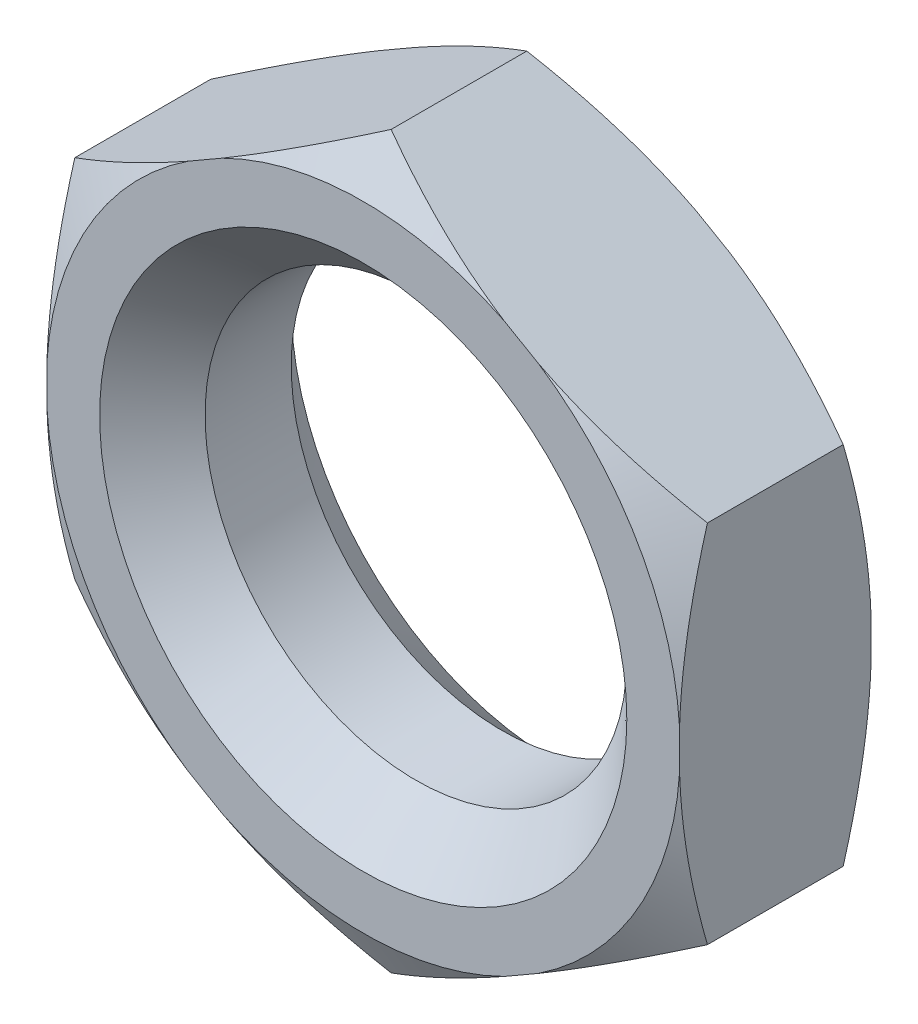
ISO-10303-21;
HEADER;
FILE_DESCRIPTION(('STEP AP214'),'2;1');
FILE_NAME('part.step','',(''),(''),'','','');
FILE_SCHEMA(('AUTOMOTIVE_DESIGN { 1 0 10303 214 1 1 1 1 }'));
ENDSEC;
DATA;
#1=APPLICATION_CONTEXT('core data for automotive mechanical design processes');
#2=APPLICATION_PROTOCOL_DEFINITION('international standard','automotive_design',2000,#1);
#3=PRODUCT_CONTEXT('',#1,'mechanical');
#4=PRODUCT('Part','Part','',(#3));
#5=PRODUCT_RELATED_PRODUCT_CATEGORY('part','',(#4));
#6=PRODUCT_DEFINITION_FORMATION('','',#4);
#7=PRODUCT_DEFINITION_CONTEXT('part definition',#1,'design');
#8=PRODUCT_DEFINITION('design','',#6,#7);
#9=PRODUCT_DEFINITION_SHAPE('','',#8);
#10=(LENGTH_UNIT() NAMED_UNIT(*) SI_UNIT(.MILLI.,.METRE.));
#11=(NAMED_UNIT(*) PLANE_ANGLE_UNIT() SI_UNIT($,.RADIAN.));
#12=(NAMED_UNIT(*) SI_UNIT($,.STERADIAN.) SOLID_ANGLE_UNIT());
#13=UNCERTAINTY_MEASURE_WITH_UNIT(LENGTH_MEASURE(1.E-05),#10,'distance_accuracy_value','');
#14=(GEOMETRIC_REPRESENTATION_CONTEXT(3) GLOBAL_UNCERTAINTY_ASSIGNED_CONTEXT((#13)) GLOBAL_UNIT_ASSIGNED_CONTEXT((#10,
#11,#12)) REPRESENTATION_CONTEXT('',''));
#15=CARTESIAN_POINT('',(0.,0.,0.));
#16=DIRECTION('',(0.,0.,1.));
#17=DIRECTION('',(1.,0.,0.));
#18=AXIS2_PLACEMENT_3D('',#15,#16,#17);
#19=CARTESIAN_POINT('',(18.,10.3923048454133,5.45));
#20=DIRECTION('',(-0.5,-0.866025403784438,0.));
#21=DIRECTION('',(0.866025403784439,-0.5,0.));
#22=AXIS2_PLACEMENT_3D('',#19,#20,#21);
#23=PLANE('',#22);
#24=CARTESIAN_POINT('',(-12.5072979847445,28.0057015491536,1.84601470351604));
#25=CARTESIAN_POINT('',(-12.2245059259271,27.8424314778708,1.6933683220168));
#26=CARTESIAN_POINT('',(-11.9413713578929,27.6789636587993,1.54156855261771));
#27=CARTESIAN_POINT('',(-11.3743571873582,27.3515978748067,1.23982794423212));
#28=CARTESIAN_POINT('',(-11.0904775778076,27.1876999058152,1.08988712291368));
#29=CARTESIAN_POINT('',(-10.2375730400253,26.6952752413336,0.643071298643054));
#30=CARTESIAN_POINT('',(-9.6673482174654,26.36605578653,0.349238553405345));
#31=CARTESIAN_POINT('',(-8.52135894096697,25.7044185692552,-0.229590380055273));
#32=CARTESIAN_POINT('',(-7.94558258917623,25.3719939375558,-0.514555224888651));
#33=CARTESIAN_POINT('',(-6.78971862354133,24.7046555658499,-1.07255585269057));
#34=CARTESIAN_POINT('',(-6.20963114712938,24.36974190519,-1.34559201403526));
#35=CARTESIAN_POINT('',(-5.02961521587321,23.6884593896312,-1.88388713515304));
#36=CARTESIAN_POINT('',(-4.42955778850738,23.3420160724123,-2.1487707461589));
#37=CARTESIAN_POINT('',(-3.22338644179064,22.6456327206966,-2.65968989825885));
#38=CARTESIAN_POINT('',(-2.61727222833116,22.2956925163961,-2.90572451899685));
#39=CARTESIAN_POINT('',(-1.39887283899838,21.5922493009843,-3.37426308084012));
#40=CARTESIAN_POINT('',(-0.786594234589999,21.2387500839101,-3.59678966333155));
#41=CARTESIAN_POINT('',(0.445234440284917,20.5275534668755,-4.01319187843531));
#42=CARTESIAN_POINT('',(1.06478356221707,20.1698566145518,-4.20707120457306));
#43=CARTESIAN_POINT('',(2.11706652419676,19.5623207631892,-4.50497866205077));
#44=CARTESIAN_POINT('',(2.54785288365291,19.313606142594,-4.6181791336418));
#45=CARTESIAN_POINT('',(3.41280827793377,18.8142239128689,-4.82590287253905));
#46=CARTESIAN_POINT('',(3.84697724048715,18.5635563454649,-4.92042653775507));
#47=CARTESIAN_POINT('',(4.7182346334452,18.0605356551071,-5.08866119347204));
#48=CARTESIAN_POINT('',(5.15532227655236,17.8081829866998,-5.1623775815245));
#49=CARTESIAN_POINT('',(6.03193535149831,17.3020701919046,-5.28713533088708));
#50=CARTESIAN_POINT('',(6.47146076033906,17.0483100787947,-5.33817690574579));
#51=CARTESIAN_POINT('',(7.34700899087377,16.542812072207,-5.415674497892));
#52=CARTESIAN_POINT('',(7.78301314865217,16.2910849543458,-5.44240936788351));
#53=CARTESIAN_POINT('',(8.65563191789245,15.787278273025,-5.47150631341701));
#54=CARTESIAN_POINT('',(9.09224652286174,15.5351987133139,-5.47386864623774));
#55=CARTESIAN_POINT('',(9.96505640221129,15.03128169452,-5.45414650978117));
#56=CARTESIAN_POINT('',(10.4012516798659,14.7794442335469,-5.43206223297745));
#57=CARTESIAN_POINT('',(11.2722970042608,14.2765459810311,-5.36411526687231));
#58=CARTESIAN_POINT('',(11.7071468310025,14.0254853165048,-5.31824887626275));
#59=CARTESIAN_POINT('',(12.733957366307,13.43265597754,-5.18302952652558));
#60=CARTESIAN_POINT('',(13.3249590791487,13.0914409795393,-5.08389172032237));
#61=CARTESIAN_POINT('',(14.50131757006,12.4122700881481,-4.84816817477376));
#62=CARTESIAN_POINT('',(15.0866735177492,12.074314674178,-4.7115770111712));
#63=CARTESIAN_POINT('',(16.2516644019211,11.4017068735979,-4.40610220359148));
#64=CARTESIAN_POINT('',(16.8312920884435,11.0670586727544,-4.23718207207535));
#65=CARTESIAN_POINT('',(17.9840453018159,10.4015162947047,-3.8723720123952));
#66=CARTESIAN_POINT('',(18.5571712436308,10.0706218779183,-3.67648381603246));
#67=CARTESIAN_POINT('',(19.7041180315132,9.40843184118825,-3.2599221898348));
#68=CARTESIAN_POINT('',(20.2778652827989,9.0771787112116,-3.03898046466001));
#69=CARTESIAN_POINT('',(21.4192808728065,8.41818211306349,-2.5785081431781));
#70=CARTESIAN_POINT('',(21.9869529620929,8.09043647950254,-2.33898987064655));
#71=CARTESIAN_POINT('',(23.1170889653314,7.43795215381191,-1.84467194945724));
#72=CARTESIAN_POINT('',(23.6795542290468,7.11321268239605,-1.58987639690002));
#73=CARTESIAN_POINT('',(24.8001368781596,6.4662439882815,-1.06763619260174));
#74=CARTESIAN_POINT('',(25.3582536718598,6.14401510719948,-0.800189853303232));
#75=CARTESIAN_POINT('',(26.3025094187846,5.59884879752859,-0.337284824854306));
#76=CARTESIAN_POINT('',(26.6896368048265,5.3753406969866,-0.144503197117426));
#77=CARTESIAN_POINT('',(27.4621851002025,4.92930973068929,0.245525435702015));
#78=CARTESIAN_POINT('',(27.8476060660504,4.7067868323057,0.442772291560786));
#79=CARTESIAN_POINT('',(28.6128368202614,4.26498065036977,0.839088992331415));
#80=CARTESIAN_POINT('',(28.9926627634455,4.04568803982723,1.03811730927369));
#81=CARTESIAN_POINT('',(29.7509618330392,3.60788386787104,1.43960243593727));
#82=CARTESIAN_POINT('',(30.1294349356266,3.38937232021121,1.64205930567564));
#83=CARTESIAN_POINT('',(30.5072979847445,3.17121298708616,1.84601470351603));
#84=B_SPLINE_CURVE_WITH_KNOTS('',3,(#24,#25,#26,#27,#28,#29,#30,#31,#32,#33,#34,#35,#36,#37,#38,
#39,#40,#41,#42,#43,#44,#45,#46,#47,#48,#49,#50,#51,#52,#53,#54,#55,#56,#57,#58,#59,#60,#61,#62,
#63,#64,#65,#66,#67,#68,#69,#70,#71,#72,#73,#74,#75,#76,#77,#78,#79,#80,#81,#82,#83),
.UNSPECIFIED.,.F.,.F.,(4,2,2,2,2,2,2,2,2,2,2,2,2,2,2,2,2,2,2,2,2,2,2,2,2,2,2,2,2,4),(0.,
1.08136929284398,2.16274885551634,4.3257597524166,6.49570389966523,8.66557916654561,
10.8907350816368,13.1159995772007,15.3391009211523,17.5619153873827,19.0920532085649,
20.6221584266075,22.1518663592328,23.6815598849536,25.1934744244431,26.7053730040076,
28.2172596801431,29.7293817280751,31.7969112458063,33.8647403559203,35.934917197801,
38.004961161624,40.0997509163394,42.193162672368,44.2860156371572,46.3791485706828,
47.8395678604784,49.2999384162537,50.744818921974,52.1897247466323),.UNSPECIFIED.);
#85=CARTESIAN_POINT('',(0.,20.7846096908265,-3.86228675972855));
#86=VERTEX_POINT('',#85);
#87=CARTESIAN_POINT('',(8.03285987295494,16.1468358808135,-5.45));
#88=VERTEX_POINT('',#87);
#89=EDGE_CURVE('E177',#86,#88,#84,.T.);
#90=ORIENTED_EDGE('',*,*,#89,.F.);
#91=DIRECTION('',(0.,0.,-1.));
#92=VECTOR('',#91,1.);
#93=CARTESIAN_POINT('',(0.,20.7846096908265,5.45));
#94=LINE('',#93,#92);
#95=CARTESIAN_POINT('',(0.,20.7846096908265,3.86228675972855));
#96=VERTEX_POINT('',#95);
#97=EDGE_CURVE('E223',#96,#86,#94,.T.);
#98=ORIENTED_EDGE('',*,*,#97,.F.);
#99=CARTESIAN_POINT('',(30.5072979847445,3.17121298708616,-1.84601470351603));
#100=CARTESIAN_POINT('',(30.2245059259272,3.33448305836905,-1.69336832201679));
#101=CARTESIAN_POINT('',(29.9413713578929,3.4979508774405,-1.5415685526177));
#102=CARTESIAN_POINT('',(29.3743571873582,3.82531666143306,-1.23982794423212));
#103=CARTESIAN_POINT('',(29.0904775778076,3.98921463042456,-1.08988712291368));
#104=CARTESIAN_POINT('',(28.2375730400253,4.4816392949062,-0.643071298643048));
#105=CARTESIAN_POINT('',(27.6673482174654,4.81085874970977,-0.349238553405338));
#106=CARTESIAN_POINT('',(26.521358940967,5.47249596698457,0.229590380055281));
#107=CARTESIAN_POINT('',(25.9455825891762,5.80492059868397,0.51455522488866));
#108=CARTESIAN_POINT('',(24.7897186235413,6.47225897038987,1.07255585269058));
#109=CARTESIAN_POINT('',(24.2096311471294,6.80717263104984,1.34559201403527));
#110=CARTESIAN_POINT('',(23.0296152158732,7.48845514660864,1.88388713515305));
#111=CARTESIAN_POINT('',(22.4295577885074,7.83489846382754,2.14877074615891));
#112=CARTESIAN_POINT('',(21.2233864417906,8.53128181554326,2.65968989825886));
#113=CARTESIAN_POINT('',(20.6172722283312,8.88122201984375,2.90572451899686));
#114=CARTESIAN_POINT('',(19.3988728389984,9.5846652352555,3.37426308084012));
#115=CARTESIAN_POINT('',(18.78659423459,9.93816445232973,3.59678966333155));
#116=CARTESIAN_POINT('',(17.5547655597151,10.6493610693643,4.01319187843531));
#117=CARTESIAN_POINT('',(16.9352164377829,11.007057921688,4.20707120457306));
#118=CARTESIAN_POINT('',(15.8829334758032,11.6145937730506,4.50497866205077));
#119=CARTESIAN_POINT('',(15.4521471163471,11.8633083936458,4.6181791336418));
#120=CARTESIAN_POINT('',(14.5871917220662,12.3626906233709,4.82590287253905));
#121=CARTESIAN_POINT('',(14.1530227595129,12.6133581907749,4.92042653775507));
#122=CARTESIAN_POINT('',(13.2817653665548,13.1163788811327,5.08866119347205));
#123=CARTESIAN_POINT('',(12.8446777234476,13.36873154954,5.1623775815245));
#124=CARTESIAN_POINT('',(11.9680646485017,13.8748443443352,5.28713533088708));
#125=CARTESIAN_POINT('',(11.5285392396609,14.1286044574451,5.33817690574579));
#126=CARTESIAN_POINT('',(10.6529910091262,14.6341024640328,5.415674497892));
#127=CARTESIAN_POINT('',(10.2169868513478,14.885829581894,5.44240936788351));
#128=CARTESIAN_POINT('',(9.34436808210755,15.3896362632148,5.47150631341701));
#129=CARTESIAN_POINT('',(8.90775347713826,15.6417158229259,5.47386864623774));
#130=CARTESIAN_POINT('',(8.03494359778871,16.1456328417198,5.45414650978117));
#131=CARTESIAN_POINT('',(7.59874832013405,16.3974703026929,5.43206223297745));
#132=CARTESIAN_POINT('',(6.72770299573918,16.9003685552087,5.3641152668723));
#133=CARTESIAN_POINT('',(6.2928531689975,17.151429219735,5.31824887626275));
#134=CARTESIAN_POINT('',(5.26604263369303,17.7442585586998,5.18302952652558));
#135=CARTESIAN_POINT('',(4.67504092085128,18.0854735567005,5.08389172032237));
#136=CARTESIAN_POINT('',(3.49868242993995,18.7646444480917,4.84816817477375));
#137=CARTESIAN_POINT('',(2.91332648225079,19.1025998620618,4.7115770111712));
#138=CARTESIAN_POINT('',(1.74833559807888,19.7752076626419,4.40610220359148));
#139=CARTESIAN_POINT('',(1.16870791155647,20.1098558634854,4.23718207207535));
#140=CARTESIAN_POINT('',(0.015954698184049,20.7753982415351,3.8723720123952));
#141=CARTESIAN_POINT('',(-0.557171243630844,21.1062926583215,3.67648381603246));
#142=CARTESIAN_POINT('',(-1.70411803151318,21.7684826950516,3.25992218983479));
#143=CARTESIAN_POINT('',(-2.27786528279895,22.0997358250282,3.03898046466));
#144=CARTESIAN_POINT('',(-3.41928087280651,22.7587324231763,2.5785081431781));
#145=CARTESIAN_POINT('',(-3.98695296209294,23.0864780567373,2.33898987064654));
#146=CARTESIAN_POINT('',(-5.11708896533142,23.7389623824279,1.84467194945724));
#147=CARTESIAN_POINT('',(-5.67955422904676,24.0637018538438,1.58987639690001));
#148=CARTESIAN_POINT('',(-6.80013687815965,24.7106705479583,1.06763619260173));
#149=CARTESIAN_POINT('',(-7.35825367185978,25.0328994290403,0.800189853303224));
#150=CARTESIAN_POINT('',(-8.30250941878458,25.5780657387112,0.337284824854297));
#151=CARTESIAN_POINT('',(-8.68963680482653,25.8015738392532,0.144503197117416));
#152=CARTESIAN_POINT('',(-9.4621851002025,26.2476048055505,-0.245525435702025));
#153=CARTESIAN_POINT('',(-9.84760606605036,26.4701277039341,-0.442772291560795));
#154=CARTESIAN_POINT('',(-10.6128368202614,26.91193388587,-0.839088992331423));
#155=CARTESIAN_POINT('',(-10.9926627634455,27.1312264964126,-1.0381173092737));
#156=CARTESIAN_POINT('',(-11.7509618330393,27.5690306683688,-1.43960243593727));
#157=CARTESIAN_POINT('',(-12.1294349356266,27.7875422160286,-1.64205930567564));
#158=CARTESIAN_POINT('',(-12.5072979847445,28.0057015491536,-1.84601470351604));
#159=B_SPLINE_CURVE_WITH_KNOTS('',3,(#99,#100,#101,#102,#103,#104,#105,#106,#107,#108,#109,#110,
#111,#112,#113,#114,#115,#116,#117,#118,#119,#120,#121,#122,#123,#124,#125,#126,#127,#128,#129,
#130,#131,#132,#133,#134,#135,#136,#137,#138,#139,#140,#141,#142,#143,#144,#145,#146,#147,#148,
#149,#150,#151,#152,#153,#154,#155,#156,#157,#158),.UNSPECIFIED.,.F.,.F.,(4,2,2,2,2,2,2,2,2,2,2,
2,2,2,2,2,2,2,2,2,2,2,2,2,2,2,2,2,2,4),(0.,1.08136929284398,2.16274885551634,4.3257597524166,
6.49570389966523,8.66557916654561,10.8907350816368,13.1159995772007,15.3391009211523,
17.5619153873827,19.0920532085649,20.6221584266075,22.1518663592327,23.6815598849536,
25.1934744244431,26.7053730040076,28.2172596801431,29.7293817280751,31.7969112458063,
33.8647403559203,35.934917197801,38.004961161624,40.0997509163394,42.193162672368,
44.2860156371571,46.3791485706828,47.8395678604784,49.2999384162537,50.744818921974,
52.1897247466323),.UNSPECIFIED.);
#160=CARTESIAN_POINT('',(8.03285987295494,16.1468358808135,5.45));
#161=VERTEX_POINT('',#160);
#162=EDGE_CURVE('E374',#161,#96,#159,.T.);
#163=ORIENTED_EDGE('',*,*,#162,.F.);
#164=DIRECTION('',(-0.866025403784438,0.5,0.));
#165=VECTOR('',#164,1.);
#166=CARTESIAN_POINT('',(18.,10.3923048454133,5.45));
#167=LINE('',#166,#165);
#168=CARTESIAN_POINT('',(9.96714012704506,15.0300786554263,5.45));
#169=VERTEX_POINT('',#168);
#170=EDGE_CURVE('E352',#169,#161,#167,.T.);
#171=ORIENTED_EDGE('',*,*,#170,.F.);
#172=CARTESIAN_POINT('',(18.,10.3923048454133,3.86228675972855));
#173=VERTEX_POINT('',#172);
#174=EDGE_CURVE('E194',#173,#169,#159,.T.);
#175=ORIENTED_EDGE('',*,*,#174,.F.);
#176=DIRECTION('',(0.,0.,-1.));
#177=VECTOR('',#176,1.);
#178=CARTESIAN_POINT('',(18.,10.3923048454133,5.45));
#179=LINE('',#178,#177);
#180=CARTESIAN_POINT('',(18.,10.3923048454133,-3.86228675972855));
#181=VERTEX_POINT('',#180);
#182=EDGE_CURVE('E183',#173,#181,#179,.T.);
#183=ORIENTED_EDGE('',*,*,#182,.T.);
#184=CARTESIAN_POINT('',(9.96714012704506,15.0300786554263,-5.45));
#185=VERTEX_POINT('',#184);
#186=EDGE_CURVE('E164',#185,#181,#84,.T.);
#187=ORIENTED_EDGE('',*,*,#186,.F.);
#188=DIRECTION('',(-0.866025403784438,0.5,0.));
#189=VECTOR('',#188,1.);
#190=CARTESIAN_POINT('',(18.,10.3923048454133,-5.45));
#191=LINE('',#190,#189);
#192=EDGE_CURVE('E265',#185,#88,#191,.T.);
#193=ORIENTED_EDGE('',*,*,#192,.T.);
#194=EDGE_LOOP('',(#90,#98,#163,#171,#175,#183,#187,#193));
#195=FACE_BOUND('',#194,.T.);
#196=ADVANCED_FACE('F39',(#195),#23,.F.);
#197=CARTESIAN_POINT('',(0.,20.7846096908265,5.45));
#198=DIRECTION('',(0.5,-0.866025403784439,0.));
#199=DIRECTION('',(0.866025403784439,0.5,0.));
#200=AXIS2_PLACEMENT_3D('',#197,#198,#199);
#201=PLANE('',#200);
#202=CARTESIAN_POINT('',(-30.5072979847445,3.17121298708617,1.84601470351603));
#203=CARTESIAN_POINT('',(-30.2245059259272,3.33448305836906,1.69336832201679));
#204=CARTESIAN_POINT('',(-29.9413713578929,3.4979508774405,1.5415685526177));
#205=CARTESIAN_POINT('',(-29.3743571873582,3.82531666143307,1.23982794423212));
#206=CARTESIAN_POINT('',(-29.0904775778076,3.98921463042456,1.08988712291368));
#207=CARTESIAN_POINT('',(-28.2375730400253,4.48163929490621,0.643071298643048));
#208=CARTESIAN_POINT('',(-27.6673482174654,4.81085874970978,0.349238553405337));
#209=CARTESIAN_POINT('',(-26.521358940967,5.47249596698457,-0.229590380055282));
#210=CARTESIAN_POINT('',(-25.9455825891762,5.80492059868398,-0.514555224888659));
#211=CARTESIAN_POINT('',(-24.7897186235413,6.47225897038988,-1.07255585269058));
#212=CARTESIAN_POINT('',(-24.2096311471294,6.80717263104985,-1.34559201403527));
#213=CARTESIAN_POINT('',(-23.0296152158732,7.48845514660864,-1.88388713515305));
#214=CARTESIAN_POINT('',(-22.4295577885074,7.83489846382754,-2.14877074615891));
#215=CARTESIAN_POINT('',(-21.2233864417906,8.53128181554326,-2.65968989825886));
#216=CARTESIAN_POINT('',(-20.6172722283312,8.88122201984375,-2.90572451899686));
#217=CARTESIAN_POINT('',(-19.3988728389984,9.58466523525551,-3.37426308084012));
#218=CARTESIAN_POINT('',(-18.78659423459,9.93816445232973,-3.59678966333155));
#219=CARTESIAN_POINT('',(-17.5547655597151,10.6493610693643,-4.01319187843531));
#220=CARTESIAN_POINT('',(-16.9352164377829,11.007057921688,-4.20707120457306));
#221=CARTESIAN_POINT('',(-15.8829334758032,11.6145937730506,-4.50497866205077));
#222=CARTESIAN_POINT('',(-15.4521471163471,11.8633083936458,-4.61817913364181));
#223=CARTESIAN_POINT('',(-14.5871917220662,12.3626906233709,-4.82590287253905));
#224=CARTESIAN_POINT('',(-14.1530227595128,12.6133581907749,-4.92042653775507));
#225=CARTESIAN_POINT('',(-13.2817653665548,13.1163788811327,-5.08866119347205));
#226=CARTESIAN_POINT('',(-12.8446777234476,13.3687315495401,-5.1623775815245));
#227=CARTESIAN_POINT('',(-11.9680646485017,13.8748443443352,-5.28713533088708));
#228=CARTESIAN_POINT('',(-11.5285392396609,14.1286044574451,-5.33817690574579));
#229=CARTESIAN_POINT('',(-10.6529910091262,14.6341024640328,-5.415674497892));
#230=CARTESIAN_POINT('',(-10.2169868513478,14.885829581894,-5.44240936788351));
#231=CARTESIAN_POINT('',(-9.34436808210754,15.3896362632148,-5.47150631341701));
#232=CARTESIAN_POINT('',(-8.90775347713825,15.6417158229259,-5.47386864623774));
#233=CARTESIAN_POINT('',(-8.0349435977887,16.1456328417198,-5.45414650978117));
#234=CARTESIAN_POINT('',(-7.59874832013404,16.3974703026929,-5.43206223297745));
#235=CARTESIAN_POINT('',(-6.72770299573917,16.9003685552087,-5.3641152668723));
#236=CARTESIAN_POINT('',(-6.29285316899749,17.151429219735,-5.31824887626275));
#237=CARTESIAN_POINT('',(-5.26604263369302,17.7442585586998,-5.18302952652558));
#238=CARTESIAN_POINT('',(-4.67504092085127,18.0854735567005,-5.08389172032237));
#239=CARTESIAN_POINT('',(-3.49868242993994,18.7646444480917,-4.84816817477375));
#240=CARTESIAN_POINT('',(-2.91332648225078,19.1025998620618,-4.7115770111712));
#241=CARTESIAN_POINT('',(-1.74833559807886,19.7752076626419,-4.40610220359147));
#242=CARTESIAN_POINT('',(-1.16870791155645,20.1098558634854,-4.23718207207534));
#243=CARTESIAN_POINT('',(-0.01595469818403,20.7753982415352,-3.87237201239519));
#244=CARTESIAN_POINT('',(0.557171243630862,21.1062926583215,-3.67648381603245));
#245=CARTESIAN_POINT('',(1.70411803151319,21.7684826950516,-3.25992218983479));
#246=CARTESIAN_POINT('',(2.27786528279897,22.0997358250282,-3.03898046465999));
#247=CARTESIAN_POINT('',(3.41928087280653,22.7587324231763,-2.57850814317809));
#248=CARTESIAN_POINT('',(3.98695296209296,23.0864780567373,-2.33898987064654));
#249=CARTESIAN_POINT('',(5.11708896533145,23.7389623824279,-1.84467194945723));
#250=CARTESIAN_POINT('',(5.67955422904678,24.0637018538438,-1.58987639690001));
#251=CARTESIAN_POINT('',(6.80013687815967,24.7106705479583,-1.06763619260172));
#252=CARTESIAN_POINT('',(7.3582536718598,25.0328994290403,-0.800189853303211));
#253=CARTESIAN_POINT('',(8.3025094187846,25.5780657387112,-0.337284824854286));
#254=CARTESIAN_POINT('',(8.68963680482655,25.8015738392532,-0.144503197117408));
#255=CARTESIAN_POINT('',(9.46218510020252,26.2476048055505,0.245525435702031));
#256=CARTESIAN_POINT('',(9.84760606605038,26.4701277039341,0.442772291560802));
#257=CARTESIAN_POINT('',(10.6128368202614,26.91193388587,0.839088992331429));
#258=CARTESIAN_POINT('',(10.9926627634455,27.1312264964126,1.0381173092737));
#259=CARTESIAN_POINT('',(11.7509618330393,27.5690306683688,1.43960243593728));
#260=CARTESIAN_POINT('',(12.1294349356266,27.7875422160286,1.64205930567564));
#261=CARTESIAN_POINT('',(12.5072979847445,28.0057015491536,1.84601470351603));
#262=B_SPLINE_CURVE_WITH_KNOTS('',3,(#202,#203,#204,#205,#206,#207,#208,#209,#210,#211,#212,
#213,#214,#215,#216,#217,#218,#219,#220,#221,#222,#223,#224,#225,#226,#227,#228,#229,#230,#231,
#232,#233,#234,#235,#236,#237,#238,#239,#240,#241,#242,#243,#244,#245,#246,#247,#248,#249,#250,
#251,#252,#253,#254,#255,#256,#257,#258,#259,#260,#261),.UNSPECIFIED.,.F.,.F.,(4,2,2,2,2,2,2,2,
2,2,2,2,2,2,2,2,2,2,2,2,2,2,2,2,2,2,2,2,2,4),(0.,1.08136929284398,2.16274885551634,
4.3257597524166,6.49570389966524,8.66557916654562,10.8907350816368,13.1159995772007,
15.3391009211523,17.5619153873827,19.0920532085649,20.6221584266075,22.1518663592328,
23.6815598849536,25.1934744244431,26.7053730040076,28.2172596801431,29.7293817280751,
31.7969112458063,33.8647403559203,35.934917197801,38.0049611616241,40.0997509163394,
42.193162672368,44.2860156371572,46.3791485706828,47.8395678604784,49.2999384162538,
50.744818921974,52.1897247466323),.UNSPECIFIED.);
#263=CARTESIAN_POINT('',(-18.,10.3923048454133,-3.86228675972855));
#264=VERTEX_POINT('',#263);
#265=CARTESIAN_POINT('',(-9.967140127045,15.0300786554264,-5.45));
#266=VERTEX_POINT('',#265);
#267=EDGE_CURVE('E55',#264,#266,#262,.T.);
#268=ORIENTED_EDGE('',*,*,#267,.F.);
#269=DIRECTION('',(0.,0.,-1.));
#270=VECTOR('',#269,1.);
#271=CARTESIAN_POINT('',(-18.,10.3923048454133,5.45));
#272=LINE('',#271,#270);
#273=CARTESIAN_POINT('',(-18.,10.3923048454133,3.86228675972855));
#274=VERTEX_POINT('',#273);
#275=EDGE_CURVE('E219',#274,#264,#272,.T.);
#276=ORIENTED_EDGE('',*,*,#275,.F.);
#277=CARTESIAN_POINT('',(12.5072979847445,28.0057015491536,-1.84601470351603));
#278=CARTESIAN_POINT('',(12.2245059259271,27.8424314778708,-1.69336832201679));
#279=CARTESIAN_POINT('',(11.9413713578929,27.6789636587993,-1.54156855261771));
#280=CARTESIAN_POINT('',(11.3743571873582,27.3515978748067,-1.23982794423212));
#281=CARTESIAN_POINT('',(11.0904775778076,27.1876999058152,-1.08988712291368));
#282=CARTESIAN_POINT('',(10.2375730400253,26.6952752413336,-0.643071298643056));
#283=CARTESIAN_POINT('',(9.6673482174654,26.36605578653,-0.349238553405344));
#284=CARTESIAN_POINT('',(8.52135894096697,25.7044185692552,0.229590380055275));
#285=CARTESIAN_POINT('',(7.94558258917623,25.3719939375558,0.514555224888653));
#286=CARTESIAN_POINT('',(6.78971862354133,24.7046555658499,1.07255585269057));
#287=CARTESIAN_POINT('',(6.20963114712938,24.36974190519,1.34559201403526));
#288=CARTESIAN_POINT('',(5.02961521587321,23.6884593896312,1.88388713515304));
#289=CARTESIAN_POINT('',(4.42955778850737,23.3420160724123,2.1487707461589));
#290=CARTESIAN_POINT('',(3.22338644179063,22.6456327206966,2.65968989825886));
#291=CARTESIAN_POINT('',(2.61727222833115,22.2956925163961,2.90572451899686));
#292=CARTESIAN_POINT('',(1.39887283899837,21.5922493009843,3.37426308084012));
#293=CARTESIAN_POINT('',(0.786594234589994,21.2387500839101,3.59678966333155));
#294=CARTESIAN_POINT('',(-0.445234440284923,20.5275534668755,4.01319187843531));
#295=CARTESIAN_POINT('',(-1.06478356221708,20.1698566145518,4.20707120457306));
#296=CARTESIAN_POINT('',(-2.11706652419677,19.5623207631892,4.50497866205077));
#297=CARTESIAN_POINT('',(-2.54785288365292,19.313606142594,4.6181791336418));
#298=CARTESIAN_POINT('',(-3.41280827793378,18.8142239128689,4.82590287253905));
#299=CARTESIAN_POINT('',(-3.84697724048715,18.5635563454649,4.92042653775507));
#300=CARTESIAN_POINT('',(-4.71823463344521,18.0605356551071,5.08866119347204));
#301=CARTESIAN_POINT('',(-5.15532227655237,17.8081829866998,5.1623775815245));
#302=CARTESIAN_POINT('',(-6.03193535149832,17.3020701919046,5.28713533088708));
#303=CARTESIAN_POINT('',(-6.47146076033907,17.0483100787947,5.33817690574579));
#304=CARTESIAN_POINT('',(-7.34700899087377,16.542812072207,5.415674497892));
#305=CARTESIAN_POINT('',(-7.78301314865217,16.2910849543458,5.44240936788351));
#306=CARTESIAN_POINT('',(-8.65563191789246,15.787278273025,5.47150631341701));
#307=CARTESIAN_POINT('',(-9.09224652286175,15.5351987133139,5.47386864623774));
#308=CARTESIAN_POINT('',(-9.9650564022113,15.03128169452,5.45414650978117));
#309=CARTESIAN_POINT('',(-10.401251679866,14.7794442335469,5.43206223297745));
#310=CARTESIAN_POINT('',(-11.2722970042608,14.2765459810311,5.3641152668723));
#311=CARTESIAN_POINT('',(-11.7071468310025,14.0254853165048,5.31824887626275));
#312=CARTESIAN_POINT('',(-12.733957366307,13.43265597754,5.18302952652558));
#313=CARTESIAN_POINT('',(-13.3249590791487,13.0914409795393,5.08389172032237));
#314=CARTESIAN_POINT('',(-14.5013175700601,12.4122700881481,4.84816817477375));
#315=CARTESIAN_POINT('',(-15.0866735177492,12.074314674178,4.7115770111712));
#316=CARTESIAN_POINT('',(-16.2516644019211,11.4017068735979,4.40610220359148));
#317=CARTESIAN_POINT('',(-16.8312920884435,11.0670586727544,4.23718207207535));
#318=CARTESIAN_POINT('',(-17.984045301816,10.4015162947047,3.87237201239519));
#319=CARTESIAN_POINT('',(-18.5571712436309,10.0706218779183,3.67648381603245));
#320=CARTESIAN_POINT('',(-19.7041180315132,9.40843184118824,3.25992218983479));
#321=CARTESIAN_POINT('',(-20.277865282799,9.07717871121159,3.03898046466));
#322=CARTESIAN_POINT('',(-21.4192808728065,8.41818211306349,2.5785081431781));
#323=CARTESIAN_POINT('',(-21.986952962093,8.09043647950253,2.33898987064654));
#324=CARTESIAN_POINT('',(-23.1170889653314,7.4379521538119,1.84467194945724));
#325=CARTESIAN_POINT('',(-23.6795542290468,7.11321268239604,1.58987639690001));
#326=CARTESIAN_POINT('',(-24.8001368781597,6.46624398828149,1.06763619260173));
#327=CARTESIAN_POINT('',(-25.3582536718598,6.14401510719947,0.800189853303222));
#328=CARTESIAN_POINT('',(-26.3025094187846,5.59884879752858,0.337284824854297));
#329=CARTESIAN_POINT('',(-26.6896368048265,5.37534069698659,0.144503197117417));
#330=CARTESIAN_POINT('',(-27.4621851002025,4.92930973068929,-0.245525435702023));
#331=CARTESIAN_POINT('',(-27.8476060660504,4.7067868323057,-0.442772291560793));
#332=CARTESIAN_POINT('',(-28.6128368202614,4.26498065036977,-0.83908899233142));
#333=CARTESIAN_POINT('',(-28.9926627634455,4.04568803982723,-1.0381173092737));
#334=CARTESIAN_POINT('',(-29.7509618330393,3.60788386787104,-1.43960243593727));
#335=CARTESIAN_POINT('',(-30.1294349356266,3.38937232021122,-1.64205930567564));
#336=CARTESIAN_POINT('',(-30.5072979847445,3.17121298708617,-1.84601470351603));
#337=B_SPLINE_CURVE_WITH_KNOTS('',3,(#277,#278,#279,#280,#281,#282,#283,#284,#285,#286,#287,
#288,#289,#290,#291,#292,#293,#294,#295,#296,#297,#298,#299,#300,#301,#302,#303,#304,#305,#306,
#307,#308,#309,#310,#311,#312,#313,#314,#315,#316,#317,#318,#319,#320,#321,#322,#323,#324,#325,
#326,#327,#328,#329,#330,#331,#332,#333,#334,#335,#336),.UNSPECIFIED.,.F.,.F.,(4,2,2,2,2,2,2,2,
2,2,2,2,2,2,2,2,2,2,2,2,2,2,2,2,2,2,2,2,2,4),(0.,1.08136929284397,2.16274885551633,
4.32575975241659,6.49570389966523,8.66557916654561,10.8907350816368,13.1159995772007,
15.3391009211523,17.5619153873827,19.0920532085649,20.6221584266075,22.1518663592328,
23.6815598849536,25.1934744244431,26.7053730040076,28.2172596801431,29.7293817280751,
31.7969112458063,33.8647403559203,35.934917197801,38.0049611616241,40.0997509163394,
42.193162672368,44.2860156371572,46.3791485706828,47.8395678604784,49.2999384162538,
50.744818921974,52.1897247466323),.UNSPECIFIED.);
#338=CARTESIAN_POINT('',(-9.967140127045,15.0300786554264,5.45));
#339=VERTEX_POINT('',#338);
#340=EDGE_CURVE('E345',#339,#274,#337,.T.);
#341=ORIENTED_EDGE('',*,*,#340,.F.);
#342=DIRECTION('',(-0.866025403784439,-0.5,0.));
#343=VECTOR('',#342,1.);
#344=CARTESIAN_POINT('',(0.,20.7846096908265,5.45));
#345=LINE('',#344,#343);
#346=CARTESIAN_POINT('',(-8.03285987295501,16.1468358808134,5.45));
#347=VERTEX_POINT('',#346);
#348=EDGE_CURVE('E356',#347,#339,#345,.T.);
#349=ORIENTED_EDGE('',*,*,#348,.F.);
#350=EDGE_CURVE('E351',#96,#347,#337,.T.);
#351=ORIENTED_EDGE('',*,*,#350,.F.);
#352=ORIENTED_EDGE('',*,*,#97,.T.);
#353=CARTESIAN_POINT('',(-8.03285987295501,16.1468358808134,-5.45));
#354=VERTEX_POINT('',#353);
#355=EDGE_CURVE('E416',#354,#86,#262,.T.);
#356=ORIENTED_EDGE('',*,*,#355,.F.);
#357=DIRECTION('',(-0.866025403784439,-0.5,0.));
#358=VECTOR('',#357,1.);
#359=CARTESIAN_POINT('',(0.,20.7846096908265,-5.45));
#360=LINE('',#359,#358);
#361=EDGE_CURVE('E373',#354,#266,#360,.T.);
#362=ORIENTED_EDGE('',*,*,#361,.T.);
#363=EDGE_LOOP('',(#268,#276,#341,#349,#351,#352,#356,#362));
#364=FACE_BOUND('',#363,.T.);
#365=ADVANCED_FACE('F326',(#364),#201,.F.);
#366=CARTESIAN_POINT('',(-18.,10.3923048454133,5.45));
#367=DIRECTION('',(1.,0.,0.));
#368=DIRECTION('',(0.,0.,-1.));
#369=AXIS2_PLACEMENT_3D('',#366,#367,#368);
#370=PLANE('',#369);
#371=CARTESIAN_POINT('',(-18.,-22.8996028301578,0.954290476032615));
#372=CARTESIAN_POINT('',(-18.,-22.5744407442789,0.806699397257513));
#373=CARTESIAN_POINT('',(-18.,-22.2488295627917,0.660098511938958));
#374=CARTESIAN_POINT('',(-18.,-21.5966292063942,0.369077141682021));
#375=CARTESIAN_POINT('',(-18.,-21.2700400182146,0.224656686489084));
#376=CARTESIAN_POINT('',(-18.,-20.2885893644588,-0.205076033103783));
#377=CARTESIAN_POINT('',(-18.,-19.6321537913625,-0.48681002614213));
#378=CARTESIAN_POINT('',(-18.,-18.3116874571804,-1.03988782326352));
#379=CARTESIAN_POINT('',(-18.,-17.6476364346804,-1.31118337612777));
#380=CARTESIAN_POINT('',(-18.,-16.313923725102,-1.83958180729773));
#381=CARTESIAN_POINT('',(-18.,-15.6442622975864,-2.09668533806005));
#382=CARTESIAN_POINT('',(-18.,-14.3014937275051,-2.59242814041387));
#383=CARTESIAN_POINT('',(-18.,-13.628415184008,-2.83114449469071));
#384=CARTESIAN_POINT('',(-18.,-12.2750654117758,-3.28750323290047));
#385=CARTESIAN_POINT('',(-18.,-11.5947938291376,-3.50514457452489));
#386=CARTESIAN_POINT('',(-18.,-10.2273780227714,-3.91437334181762));
#387=CARTESIAN_POINT('',(-18.,-9.54024403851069,-4.10599472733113));
#388=CARTESIAN_POINT('',(-18.,-8.15802361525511,-4.45806154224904));
#389=CARTESIAN_POINT('',(-18.,-7.46293830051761,-4.61851132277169));
#390=CARTESIAN_POINT('',(-18.,-6.26309474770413,-4.86218916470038));
#391=CARTESIAN_POINT('',(-18.,-5.76016393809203,-4.95441928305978));
#392=CARTESIAN_POINT('',(-18.,-4.75086267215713,-5.11773573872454));
#393=CARTESIAN_POINT('',(-18.,-4.24449232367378,-5.18882273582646));
#394=CARTESIAN_POINT('',(-18.,-3.22915834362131,-5.30797453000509));
#395=CARTESIAN_POINT('',(-18.,-2.72019539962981,-5.35604513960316));
#396=CARTESIAN_POINT('',(-18.,-1.7005377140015,-5.4277954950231));
#397=CARTESIAN_POINT('',(-18.,-1.18984297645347,-5.45147529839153));
#398=CARTESIAN_POINT('',(-18.,-0.168166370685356,-5.47370568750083));
#399=CARTESIAN_POINT('',(-18.,0.342815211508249,-5.47226929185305));
#400=CARTESIAN_POINT('',(-18.,1.36408355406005,-5.44434498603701));
#401=CARTESIAN_POINT('',(-18.,1.8743703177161,-5.41785719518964));
#402=CARTESIAN_POINT('',(-18.,2.8931441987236,-5.34063900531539));
#403=CARTESIAN_POINT('',(-18.,3.40163112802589,-5.28990614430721));
#404=CARTESIAN_POINT('',(-18.,4.41579971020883,-5.16565842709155));
#405=CARTESIAN_POINT('',(-18.,4.92148124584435,-5.09214262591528));
#406=CARTESIAN_POINT('',(-18.,6.18186903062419,-4.8821351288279));
#407=CARTESIAN_POINT('',(-18.,6.93440306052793,-4.73254534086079));
#408=CARTESIAN_POINT('',(-18.,8.43043995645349,-4.39351494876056));
#409=CARTESIAN_POINT('',(-18.,9.17394076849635,-4.20406545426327));
#410=CARTESIAN_POINT('',(-18.,10.653389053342,-3.7920230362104));
#411=CARTESIAN_POINT('',(-18.,11.3893161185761,-3.56935754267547));
#412=CARTESIAN_POINT('',(-18.,12.8524878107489,-3.09751551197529));
#413=CARTESIAN_POINT('',(-18.,13.5797330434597,-2.84834083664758));
#414=CARTESIAN_POINT('',(-18.,15.0348420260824,-2.32569053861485));
#415=CARTESIAN_POINT('',(-18.,15.7626166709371,-2.05196836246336));
#416=CARTESIAN_POINT('',(-18.,17.2113545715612,-1.48701321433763));
#417=CARTESIAN_POINT('',(-18.,17.9323173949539,-1.19577913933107));
#418=CARTESIAN_POINT('',(-18.,19.3638902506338,-0.601064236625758));
#419=CARTESIAN_POINT('',(-18.,20.0745368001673,-0.29767103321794));
#420=CARTESIAN_POINT('',(-18.,21.1366966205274,0.165879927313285));
#421=CARTESIAN_POINT('',(-18.,21.490074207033,0.321788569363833));
#422=CARTESIAN_POINT('',(-18.,22.1956770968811,0.636175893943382));
#423=CARTESIAN_POINT('',(-18.,22.5479024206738,0.794654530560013));
#424=CARTESIAN_POINT('',(-18.,22.8996028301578,0.954290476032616));
#425=B_SPLINE_CURVE_WITH_KNOTS('',3,(#371,#372,#373,#374,#375,#376,#377,#378,#379,#380,#381,
#382,#383,#384,#385,#386,#387,#388,#389,#390,#391,#392,#393,#394,#395,#396,#397,#398,#399,#400,
#401,#402,#403,#404,#405,#406,#407,#408,#409,#410,#411,#412,#413,#414,#415,#416,#417,#418,#419,
#420,#421,#422,#423,#424),.UNSPECIFIED.,.F.,.F.,(4,2,2,2,2,2,2,2,2,2,2,2,2,2,2,2,2,2,2,2,2,2,2,
2,2,2,4),(0.,1.07126790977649,2.14255042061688,4.28547465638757,6.43733910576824,
8.58910454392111,10.7312935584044,12.8735884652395,15.0130599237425,17.1522325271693,
18.6857949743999,20.2193095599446,21.7524366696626,23.2855601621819,24.8178890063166,
26.3502105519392,27.8826877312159,29.4152284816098,31.71561395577,34.0165130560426,
36.3225148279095,38.6283547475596,40.9607175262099,43.2932273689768,45.6112022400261,
46.7699214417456,47.9286199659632),.UNSPECIFIED.);
#426=CARTESIAN_POINT('',(-18.,-10.3923048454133,-3.86228675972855));
#427=VERTEX_POINT('',#426);
#428=CARTESIAN_POINT('',(-18.,-1.11675722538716,-5.45));
#429=VERTEX_POINT('',#428);
#430=EDGE_CURVE('E63',#427,#429,#425,.T.);
#431=ORIENTED_EDGE('',*,*,#430,.F.);
#432=DIRECTION('',(0.,0.,-1.));
#433=VECTOR('',#432,1.);
#434=CARTESIAN_POINT('',(-18.,-10.3923048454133,5.45));
#435=LINE('',#434,#433);
#436=CARTESIAN_POINT('',(-18.,-10.3923048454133,3.86228675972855));
#437=VERTEX_POINT('',#436);
#438=EDGE_CURVE('E215',#437,#427,#435,.T.);
#439=ORIENTED_EDGE('',*,*,#438,.F.);
#440=CARTESIAN_POINT('',(-18.,22.8996028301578,-0.954290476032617));
#441=CARTESIAN_POINT('',(-18.,22.5744407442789,-0.806699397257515));
#442=CARTESIAN_POINT('',(-18.,22.2488295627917,-0.66009851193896));
#443=CARTESIAN_POINT('',(-18.,21.5966292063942,-0.369077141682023));
#444=CARTESIAN_POINT('',(-18.,21.2700400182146,-0.224656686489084));
#445=CARTESIAN_POINT('',(-18.,20.2885893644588,0.205076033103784));
#446=CARTESIAN_POINT('',(-18.,19.6321537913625,0.486810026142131));
#447=CARTESIAN_POINT('',(-18.,18.3116874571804,1.03988782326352));
#448=CARTESIAN_POINT('',(-18.,17.6476364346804,1.31118337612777));
#449=CARTESIAN_POINT('',(-18.,16.313923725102,1.83958180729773));
#450=CARTESIAN_POINT('',(-18.,15.6442622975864,2.09668533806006));
#451=CARTESIAN_POINT('',(-18.,14.3014937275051,2.59242814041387));
#452=CARTESIAN_POINT('',(-18.,13.628415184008,2.83114449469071));
#453=CARTESIAN_POINT('',(-18.,12.2750654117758,3.28750323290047));
#454=CARTESIAN_POINT('',(-18.,11.5947938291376,3.50514457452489));
#455=CARTESIAN_POINT('',(-18.,10.2273780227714,3.91437334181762));
#456=CARTESIAN_POINT('',(-18.,9.5402440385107,4.10599472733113));
#457=CARTESIAN_POINT('',(-18.,8.15802361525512,4.45806154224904));
#458=CARTESIAN_POINT('',(-18.,7.46293830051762,4.61851132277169));
#459=CARTESIAN_POINT('',(-18.,6.26309474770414,4.86218916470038));
#460=CARTESIAN_POINT('',(-18.,5.76016393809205,4.95441928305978));
#461=CARTESIAN_POINT('',(-18.,4.75086267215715,5.11773573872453));
#462=CARTESIAN_POINT('',(-18.,4.2444923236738,5.18882273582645));
#463=CARTESIAN_POINT('',(-18.,3.22915834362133,5.30797453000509));
#464=CARTESIAN_POINT('',(-18.,2.72019539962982,5.35604513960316));
#465=CARTESIAN_POINT('',(-18.,1.70053771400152,5.4277954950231));
#466=CARTESIAN_POINT('',(-18.,1.18984297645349,5.45147529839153));
#467=CARTESIAN_POINT('',(-18.,0.168166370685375,5.47370568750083));
#468=CARTESIAN_POINT('',(-18.,-0.342815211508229,5.47226929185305));
#469=CARTESIAN_POINT('',(-18.,-1.36408355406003,5.44434498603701));
#470=CARTESIAN_POINT('',(-18.,-1.87437031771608,5.41785719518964));
#471=CARTESIAN_POINT('',(-18.,-2.89314419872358,5.34063900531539));
#472=CARTESIAN_POINT('',(-18.,-3.40163112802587,5.28990614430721));
#473=CARTESIAN_POINT('',(-18.,-4.41579971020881,5.16565842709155));
#474=CARTESIAN_POINT('',(-18.,-4.92148124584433,5.09214262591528));
#475=CARTESIAN_POINT('',(-18.,-6.18186903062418,4.8821351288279));
#476=CARTESIAN_POINT('',(-18.,-6.93440306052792,4.7325453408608));
#477=CARTESIAN_POINT('',(-18.,-8.43043995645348,4.39351494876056));
#478=CARTESIAN_POINT('',(-18.,-9.17394076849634,4.20406545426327));
#479=CARTESIAN_POINT('',(-18.,-10.653389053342,3.7920230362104));
#480=CARTESIAN_POINT('',(-18.,-11.3893161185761,3.56935754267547));
#481=CARTESIAN_POINT('',(-18.,-12.8524878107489,3.09751551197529));
#482=CARTESIAN_POINT('',(-18.,-13.5797330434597,2.84834083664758));
#483=CARTESIAN_POINT('',(-18.,-15.0348420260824,2.32569053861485));
#484=CARTESIAN_POINT('',(-18.,-15.7626166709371,2.05196836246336));
#485=CARTESIAN_POINT('',(-18.,-17.2113545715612,1.48701321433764));
#486=CARTESIAN_POINT('',(-18.,-17.9323173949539,1.19577913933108));
#487=CARTESIAN_POINT('',(-18.,-19.3638902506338,0.601064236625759));
#488=CARTESIAN_POINT('',(-18.,-20.0745368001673,0.297671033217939));
#489=CARTESIAN_POINT('',(-18.,-21.1366966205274,-0.165879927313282));
#490=CARTESIAN_POINT('',(-18.,-21.490074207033,-0.321788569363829));
#491=CARTESIAN_POINT('',(-18.,-22.1956770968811,-0.636175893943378));
#492=CARTESIAN_POINT('',(-18.,-22.5479024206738,-0.794654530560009));
#493=CARTESIAN_POINT('',(-18.,-22.8996028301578,-0.954290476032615));
#494=B_SPLINE_CURVE_WITH_KNOTS('',3,(#440,#441,#442,#443,#444,#445,#446,#447,#448,#449,#450,
#451,#452,#453,#454,#455,#456,#457,#458,#459,#460,#461,#462,#463,#464,#465,#466,#467,#468,#469,
#470,#471,#472,#473,#474,#475,#476,#477,#478,#479,#480,#481,#482,#483,#484,#485,#486,#487,#488,
#489,#490,#491,#492,#493),.UNSPECIFIED.,.F.,.F.,(4,2,2,2,2,2,2,2,2,2,2,2,2,2,2,2,2,2,2,2,2,2,2,
2,2,2,4),(0.,1.07126790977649,2.14255042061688,4.28547465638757,6.43733910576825,
8.58910454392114,10.7312935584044,12.8735884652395,15.0130599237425,17.1522325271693,
18.6857949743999,20.2193095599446,21.7524366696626,23.2855601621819,24.8178890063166,
26.3502105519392,27.8826877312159,29.4152284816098,31.71561395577,34.0165130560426,
36.3225148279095,38.6283547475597,40.9607175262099,43.2932273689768,45.6112022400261,
46.7699214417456,47.9286199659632),.UNSPECIFIED.);
#495=CARTESIAN_POINT('',(-18.,-1.11675722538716,5.45));
#496=VERTEX_POINT('',#495);
#497=EDGE_CURVE('E332',#496,#437,#494,.T.);
#498=ORIENTED_EDGE('',*,*,#497,.F.);
#499=DIRECTION('',(0.,-1.,0.));
#500=VECTOR('',#499,1.);
#501=CARTESIAN_POINT('',(-18.,10.3923048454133,5.45));
#502=LINE('',#501,#500);
#503=CARTESIAN_POINT('',(-18.,1.11675722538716,5.45));
#504=VERTEX_POINT('',#503);
#505=EDGE_CURVE('E360',#504,#496,#502,.T.);
#506=ORIENTED_EDGE('',*,*,#505,.F.);
#507=EDGE_CURVE('E338',#274,#504,#494,.T.);
#508=ORIENTED_EDGE('',*,*,#507,.F.);
#509=ORIENTED_EDGE('',*,*,#275,.T.);
#510=CARTESIAN_POINT('',(-18.,1.11675722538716,-5.45));
#511=VERTEX_POINT('',#510);
#512=EDGE_CURVE('E315',#511,#264,#425,.T.);
#513=ORIENTED_EDGE('',*,*,#512,.F.);
#514=DIRECTION('',(0.,-1.,0.));
#515=VECTOR('',#514,1.);
#516=CARTESIAN_POINT('',(-18.,10.3923048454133,-5.45));
#517=LINE('',#516,#515);
#518=EDGE_CURVE('E378',#511,#429,#517,.T.);
#519=ORIENTED_EDGE('',*,*,#518,.T.);
#520=EDGE_LOOP('',(#431,#439,#498,#506,#508,#509,#513,#519));
#521=FACE_BOUND('',#520,.T.);
#522=ADVANCED_FACE('F322',(#521),#370,.F.);
#523=CARTESIAN_POINT('',(-18.,-10.3923048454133,5.45));
#524=DIRECTION('',(0.5,0.866025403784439,0.));
#525=DIRECTION('',(-0.866025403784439,0.5,0.));
#526=AXIS2_PLACEMENT_3D('',#523,#524,#525);
#527=PLANE('',#526);
#528=CARTESIAN_POINT('',(12.5072979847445,-28.0057015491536,1.84601470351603));
#529=CARTESIAN_POINT('',(12.2245059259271,-27.8424314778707,1.69336832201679));
#530=CARTESIAN_POINT('',(11.9413713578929,-27.6789636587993,1.5415685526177));
#531=CARTESIAN_POINT('',(11.3743571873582,-27.3515978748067,1.23982794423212));
#532=CARTESIAN_POINT('',(11.0904775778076,-27.1876999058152,1.08988712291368));
#533=CARTESIAN_POINT('',(10.2375730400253,-26.6952752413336,0.643071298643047));
#534=CARTESIAN_POINT('',(9.66734821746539,-26.36605578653,0.349238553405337));
#535=CARTESIAN_POINT('',(8.52135894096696,-25.7044185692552,-0.229590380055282));
#536=CARTESIAN_POINT('',(7.94558258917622,-25.3719939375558,-0.514555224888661));
#537=CARTESIAN_POINT('',(6.78971862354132,-24.7046555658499,-1.07255585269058));
#538=CARTESIAN_POINT('',(6.20963114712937,-24.36974190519,-1.34559201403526));
#539=CARTESIAN_POINT('',(5.0296152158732,-23.6884593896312,-1.88388713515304));
#540=CARTESIAN_POINT('',(4.42955778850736,-23.3420160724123,-2.14877074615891));
#541=CARTESIAN_POINT('',(3.22338644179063,-22.6456327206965,-2.65968989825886));
#542=CARTESIAN_POINT('',(2.61727222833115,-22.2956925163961,-2.90572451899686));
#543=CARTESIAN_POINT('',(1.39887283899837,-21.5922493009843,-3.37426308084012));
#544=CARTESIAN_POINT('',(0.786594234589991,-21.2387500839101,-3.59678966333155));
#545=CARTESIAN_POINT('',(-0.445234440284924,-20.5275534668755,-4.01319187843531));
#546=CARTESIAN_POINT('',(-1.06478356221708,-20.1698566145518,-4.20707120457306));
#547=CARTESIAN_POINT('',(-2.11706652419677,-19.5623207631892,-4.50497866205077));
#548=CARTESIAN_POINT('',(-2.54785288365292,-19.313606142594,-4.61817913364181));
#549=CARTESIAN_POINT('',(-3.41280827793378,-18.8142239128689,-4.82590287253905));
#550=CARTESIAN_POINT('',(-3.84697724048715,-18.5635563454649,-4.92042653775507));
#551=CARTESIAN_POINT('',(-4.71823463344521,-18.0605356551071,-5.08866119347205));
#552=CARTESIAN_POINT('',(-5.15532227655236,-17.8081829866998,-5.1623775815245));
#553=CARTESIAN_POINT('',(-6.03193535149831,-17.3020701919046,-5.28713533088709));
#554=CARTESIAN_POINT('',(-6.47146076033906,-17.0483100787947,-5.33817690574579));
#555=CARTESIAN_POINT('',(-7.34700899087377,-16.542812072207,-5.415674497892));
#556=CARTESIAN_POINT('',(-7.78301314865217,-16.2910849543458,-5.44240936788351));
#557=CARTESIAN_POINT('',(-8.65563191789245,-15.787278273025,-5.47150631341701));
#558=CARTESIAN_POINT('',(-9.09224652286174,-15.5351987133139,-5.47386864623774));
#559=CARTESIAN_POINT('',(-9.96505640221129,-15.03128169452,-5.45414650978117));
#560=CARTESIAN_POINT('',(-10.4012516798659,-14.7794442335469,-5.43206223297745));
#561=CARTESIAN_POINT('',(-11.2722970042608,-14.2765459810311,-5.36411526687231));
#562=CARTESIAN_POINT('',(-11.7071468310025,-14.0254853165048,-5.31824887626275));
#563=CARTESIAN_POINT('',(-12.733957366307,-13.43265597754,-5.18302952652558));
#564=CARTESIAN_POINT('',(-13.3249590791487,-13.0914409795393,-5.08389172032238));
#565=CARTESIAN_POINT('',(-14.50131757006,-12.4122700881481,-4.84816817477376));
#566=CARTESIAN_POINT('',(-15.0866735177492,-12.074314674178,-4.71157701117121));
#567=CARTESIAN_POINT('',(-16.2516644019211,-11.4017068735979,-4.40610220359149));
#568=CARTESIAN_POINT('',(-16.8312920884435,-11.0670586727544,-4.23718207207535));
#569=CARTESIAN_POINT('',(-17.9840453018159,-10.4015162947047,-3.8723720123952));
#570=CARTESIAN_POINT('',(-18.5571712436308,-10.0706218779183,-3.67648381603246));
#571=CARTESIAN_POINT('',(-19.7041180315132,-9.40843184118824,-3.2599221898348));
#572=CARTESIAN_POINT('',(-20.2778652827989,-9.07717871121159,-3.03898046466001));
#573=CARTESIAN_POINT('',(-21.4192808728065,-8.41818211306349,-2.5785081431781));
#574=CARTESIAN_POINT('',(-21.9869529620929,-8.09043647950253,-2.33898987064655));
#575=CARTESIAN_POINT('',(-23.1170889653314,-7.43795215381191,-1.84467194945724));
#576=CARTESIAN_POINT('',(-23.6795542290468,-7.11321268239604,-1.58987639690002));
#577=CARTESIAN_POINT('',(-24.8001368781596,-6.46624398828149,-1.06763619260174));
#578=CARTESIAN_POINT('',(-25.3582536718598,-6.14401510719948,-0.800189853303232));
#579=CARTESIAN_POINT('',(-26.3025094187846,-5.59884879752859,-0.337284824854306));
#580=CARTESIAN_POINT('',(-26.6896368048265,-5.37534069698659,-0.144503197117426));
#581=CARTESIAN_POINT('',(-27.4621851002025,-4.92930973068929,0.245525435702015));
#582=CARTESIAN_POINT('',(-27.8476060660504,-4.7067868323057,0.442772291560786));
#583=CARTESIAN_POINT('',(-28.6128368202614,-4.26498065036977,0.839088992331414));
#584=CARTESIAN_POINT('',(-28.9926627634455,-4.04568803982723,1.03811730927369));
#585=CARTESIAN_POINT('',(-29.7509618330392,-3.60788386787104,1.43960243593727));
#586=CARTESIAN_POINT('',(-30.1294349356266,-3.38937232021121,1.64205930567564));
#587=CARTESIAN_POINT('',(-30.5072979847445,-3.17121298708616,1.84601470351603));
#588=B_SPLINE_CURVE_WITH_KNOTS('',3,(#528,#529,#530,#531,#532,#533,#534,#535,#536,#537,#538,
#539,#540,#541,#542,#543,#544,#545,#546,#547,#548,#549,#550,#551,#552,#553,#554,#555,#556,#557,
#558,#559,#560,#561,#562,#563,#564,#565,#566,#567,#568,#569,#570,#571,#572,#573,#574,#575,#576,
#577,#578,#579,#580,#581,#582,#583,#584,#585,#586,#587),.UNSPECIFIED.,.F.,.F.,(4,2,2,2,2,2,2,2,
2,2,2,2,2,2,2,2,2,2,2,2,2,2,2,2,2,2,2,2,2,4),(0.,1.08136929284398,2.16274885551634,
4.3257597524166,6.49570389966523,8.66557916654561,10.8907350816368,13.1159995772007,
15.3391009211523,17.5619153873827,19.0920532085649,20.6221584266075,22.1518663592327,
23.6815598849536,25.1934744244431,26.7053730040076,28.2172596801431,29.7293817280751,
31.7969112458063,33.8647403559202,35.9349171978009,38.004961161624,40.0997509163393,
42.193162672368,44.2860156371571,46.3791485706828,47.8395678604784,49.2999384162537,
50.744818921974,52.1897247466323),.UNSPECIFIED.);
#589=CARTESIAN_POINT('',(0.,-20.7846096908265,-3.86228675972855));
#590=VERTEX_POINT('',#589);
#591=CARTESIAN_POINT('',(-8.0328598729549,-16.1468358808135,-5.45));
#592=VERTEX_POINT('',#591);
#593=EDGE_CURVE('E304',#590,#592,#588,.T.);
#594=ORIENTED_EDGE('',*,*,#593,.F.);
#595=DIRECTION('',(0.,0.,-1.));
#596=VECTOR('',#595,1.);
#597=CARTESIAN_POINT('',(0.,-20.7846096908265,5.45));
#598=LINE('',#597,#596);
#599=CARTESIAN_POINT('',(0.,-20.7846096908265,3.86228675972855));
#600=VERTEX_POINT('',#599);
#601=EDGE_CURVE('E203',#600,#590,#598,.T.);
#602=ORIENTED_EDGE('',*,*,#601,.F.);
#603=CARTESIAN_POINT('',(-30.5072979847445,-3.17121298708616,-1.84601470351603));
#604=CARTESIAN_POINT('',(-30.2245059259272,-3.33448305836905,-1.69336832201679));
#605=CARTESIAN_POINT('',(-29.9413713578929,-3.49795087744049,-1.5415685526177));
#606=CARTESIAN_POINT('',(-29.3743571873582,-3.82531666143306,-1.23982794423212));
#607=CARTESIAN_POINT('',(-29.0904775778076,-3.98921463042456,-1.08988712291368));
#608=CARTESIAN_POINT('',(-28.2375730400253,-4.4816392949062,-0.643071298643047));
#609=CARTESIAN_POINT('',(-27.6673482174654,-4.81085874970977,-0.349238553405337));
#610=CARTESIAN_POINT('',(-26.521358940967,-5.47249596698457,0.229590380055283));
#611=CARTESIAN_POINT('',(-25.9455825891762,-5.80492059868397,0.514555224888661));
#612=CARTESIAN_POINT('',(-24.7897186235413,-6.47225897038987,1.07255585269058));
#613=CARTESIAN_POINT('',(-24.2096311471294,-6.80717263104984,1.34559201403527));
#614=CARTESIAN_POINT('',(-23.0296152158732,-7.48845514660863,1.88388713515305));
#615=CARTESIAN_POINT('',(-22.4295577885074,-7.83489846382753,2.14877074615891));
#616=CARTESIAN_POINT('',(-21.2233864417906,-8.53128181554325,2.65968989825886));
#617=CARTESIAN_POINT('',(-20.6172722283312,-8.88122201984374,2.90572451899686));
#618=CARTESIAN_POINT('',(-19.3988728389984,-9.58466523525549,3.37426308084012));
#619=CARTESIAN_POINT('',(-18.78659423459,-9.93816445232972,3.59678966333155));
#620=CARTESIAN_POINT('',(-17.5547655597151,-10.6493610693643,4.01319187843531));
#621=CARTESIAN_POINT('',(-16.9352164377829,-11.007057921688,4.20707120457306));
#622=CARTESIAN_POINT('',(-15.8829334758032,-11.6145937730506,4.50497866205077));
#623=CARTESIAN_POINT('',(-15.4521471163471,-11.8633083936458,4.6181791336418));
#624=CARTESIAN_POINT('',(-14.5871917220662,-12.3626906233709,4.82590287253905));
#625=CARTESIAN_POINT('',(-14.1530227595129,-12.6133581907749,4.92042653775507));
#626=CARTESIAN_POINT('',(-13.2817653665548,-13.1163788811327,5.08866119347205));
#627=CARTESIAN_POINT('',(-12.8446777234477,-13.36873154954,5.1623775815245));
#628=CARTESIAN_POINT('',(-11.9680646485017,-13.8748443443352,5.28713533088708));
#629=CARTESIAN_POINT('',(-11.528539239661,-14.1286044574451,5.33817690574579));
#630=CARTESIAN_POINT('',(-10.6529910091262,-14.6341024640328,5.415674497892));
#631=CARTESIAN_POINT('',(-10.2169868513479,-14.885829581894,5.44240936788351));
#632=CARTESIAN_POINT('',(-9.34436808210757,-15.3896362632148,5.47150631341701));
#633=CARTESIAN_POINT('',(-8.90775347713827,-15.6417158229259,5.47386864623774));
#634=CARTESIAN_POINT('',(-8.03494359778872,-16.1456328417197,5.45414650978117));
#635=CARTESIAN_POINT('',(-7.59874832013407,-16.3974703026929,5.43206223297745));
#636=CARTESIAN_POINT('',(-6.72770299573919,-16.9003685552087,5.36411526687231));
#637=CARTESIAN_POINT('',(-6.29285316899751,-17.151429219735,5.31824887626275));
#638=CARTESIAN_POINT('',(-5.26604263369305,-17.7442585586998,5.18302952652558));
#639=CARTESIAN_POINT('',(-4.67504092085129,-18.0854735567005,5.08389172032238));
#640=CARTESIAN_POINT('',(-3.49868242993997,-18.7646444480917,4.84816817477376));
#641=CARTESIAN_POINT('',(-2.91332648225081,-19.1025998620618,4.71157701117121));
#642=CARTESIAN_POINT('',(-1.7483355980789,-19.7752076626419,4.40610220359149));
#643=CARTESIAN_POINT('',(-1.16870791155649,-20.1098558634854,4.23718207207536));
#644=CARTESIAN_POINT('',(-0.0159546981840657,-20.7753982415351,3.8723720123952));
#645=CARTESIAN_POINT('',(0.557171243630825,-21.1062926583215,3.67648381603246));
#646=CARTESIAN_POINT('',(1.70411803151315,-21.7684826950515,3.2599221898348));
#647=CARTESIAN_POINT('',(2.27786528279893,-22.0997358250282,3.03898046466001));
#648=CARTESIAN_POINT('',(3.41928087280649,-22.7587324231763,2.57850814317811));
#649=CARTESIAN_POINT('',(3.98695296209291,-23.0864780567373,2.33898987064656));
#650=CARTESIAN_POINT('',(5.1170889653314,-23.7389623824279,1.84467194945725));
#651=CARTESIAN_POINT('',(5.67955422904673,-24.0637018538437,1.58987639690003));
#652=CARTESIAN_POINT('',(6.80013687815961,-24.7106705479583,1.06763619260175));
#653=CARTESIAN_POINT('',(7.35825367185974,-25.0328994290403,0.800189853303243));
#654=CARTESIAN_POINT('',(8.30250941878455,-25.5780657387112,0.337284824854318));
#655=CARTESIAN_POINT('',(8.6896368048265,-25.8015738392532,0.144503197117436));
#656=CARTESIAN_POINT('',(9.46218510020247,-26.2476048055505,-0.245525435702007));
#657=CARTESIAN_POINT('',(9.84760606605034,-26.4701277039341,-0.442772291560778));
#658=CARTESIAN_POINT('',(10.6128368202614,-26.91193388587,-0.839088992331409));
#659=CARTESIAN_POINT('',(10.9926627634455,-27.1312264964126,-1.03811730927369));
#660=CARTESIAN_POINT('',(11.7509618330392,-27.5690306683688,-1.43960243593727));
#661=CARTESIAN_POINT('',(12.1294349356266,-27.7875422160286,-1.64205930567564));
#662=CARTESIAN_POINT('',(12.5072979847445,-28.0057015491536,-1.84601470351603));
#663=B_SPLINE_CURVE_WITH_KNOTS('',3,(#603,#604,#605,#606,#607,#608,#609,#610,#611,#612,#613,
#614,#615,#616,#617,#618,#619,#620,#621,#622,#623,#624,#625,#626,#627,#628,#629,#630,#631,#632,
#633,#634,#635,#636,#637,#638,#639,#640,#641,#642,#643,#644,#645,#646,#647,#648,#649,#650,#651,
#652,#653,#654,#655,#656,#657,#658,#659,#660,#661,#662),.UNSPECIFIED.,.F.,.F.,(4,2,2,2,2,2,2,2,
2,2,2,2,2,2,2,2,2,2,2,2,2,2,2,2,2,2,2,2,2,4),(0.,1.08136929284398,2.16274885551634,
4.3257597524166,6.49570389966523,8.66557916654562,10.8907350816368,13.1159995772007,
15.3391009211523,17.5619153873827,19.0920532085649,20.6221584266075,22.1518663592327,
23.6815598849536,25.1934744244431,26.7053730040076,28.2172596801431,29.7293817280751,
31.7969112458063,33.8647403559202,35.9349171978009,38.004961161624,40.0997509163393,
42.193162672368,44.2860156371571,46.3791485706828,47.8395678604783,49.2999384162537,
50.744818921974,52.1897247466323),.UNSPECIFIED.);
#664=CARTESIAN_POINT('',(-8.0328598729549,-16.1468358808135,5.45));
#665=VERTEX_POINT('',#664);
#666=EDGE_CURVE('E340',#665,#600,#663,.T.);
#667=ORIENTED_EDGE('',*,*,#666,.F.);
#668=DIRECTION('',(0.866025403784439,-0.5,0.));
#669=VECTOR('',#668,1.);
#670=CARTESIAN_POINT('',(-18.,-10.3923048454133,5.45));
#671=LINE('',#670,#669);
#672=CARTESIAN_POINT('',(-9.9671401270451,-15.0300786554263,5.45));
#673=VERTEX_POINT('',#672);
#674=EDGE_CURVE('E364',#673,#665,#671,.T.);
#675=ORIENTED_EDGE('',*,*,#674,.F.);
#676=EDGE_CURVE('E339',#437,#673,#663,.T.);
#677=ORIENTED_EDGE('',*,*,#676,.F.);
#678=ORIENTED_EDGE('',*,*,#438,.T.);
#679=CARTESIAN_POINT('',(-9.9671401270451,-15.0300786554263,-5.45));
#680=VERTEX_POINT('',#679);
#681=EDGE_CURVE('E316',#680,#427,#588,.T.);
#682=ORIENTED_EDGE('',*,*,#681,.F.);
#683=DIRECTION('',(0.866025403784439,-0.5,0.));
#684=VECTOR('',#683,1.);
#685=CARTESIAN_POINT('',(-18.,-10.3923048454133,-5.45));
#686=LINE('',#685,#684);
#687=EDGE_CURVE('E382',#680,#592,#686,.T.);
#688=ORIENTED_EDGE('',*,*,#687,.T.);
#689=EDGE_LOOP('',(#594,#602,#667,#675,#677,#678,#682,#688));
#690=FACE_BOUND('',#689,.T.);
#691=ADVANCED_FACE('F325',(#690),#527,.F.);
#692=CARTESIAN_POINT('',(0.,-20.7846096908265,5.45));
#693=DIRECTION('',(-0.5,0.866025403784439,0.));
#694=DIRECTION('',(-0.866025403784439,-0.5,0.));
#695=AXIS2_PLACEMENT_3D('',#692,#693,#694);
#696=PLANE('',#695);
#697=CARTESIAN_POINT('',(30.5072979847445,-3.17121298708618,1.84601470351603));
#698=CARTESIAN_POINT('',(30.2245059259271,-3.33448305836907,1.69336832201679));
#699=CARTESIAN_POINT('',(29.9413713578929,-3.49795087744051,1.5415685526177));
#700=CARTESIAN_POINT('',(29.3743571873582,-3.82531666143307,1.23982794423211));
#701=CARTESIAN_POINT('',(29.0904775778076,-3.98921463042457,1.08988712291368));
#702=CARTESIAN_POINT('',(28.2375730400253,-4.48163929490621,0.643071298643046));
#703=CARTESIAN_POINT('',(27.6673482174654,-4.81085874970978,0.349238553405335));
#704=CARTESIAN_POINT('',(26.521358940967,-5.47249596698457,-0.229590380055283));
#705=CARTESIAN_POINT('',(25.9455825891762,-5.80492059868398,-0.51455522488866));
#706=CARTESIAN_POINT('',(24.7897186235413,-6.47225897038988,-1.07255585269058));
#707=CARTESIAN_POINT('',(24.2096311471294,-6.80717263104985,-1.34559201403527));
#708=CARTESIAN_POINT('',(23.0296152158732,-7.48845514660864,-1.88388713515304));
#709=CARTESIAN_POINT('',(22.4295577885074,-7.83489846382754,-2.14877074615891));
#710=CARTESIAN_POINT('',(21.2233864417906,-8.53128181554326,-2.65968989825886));
#711=CARTESIAN_POINT('',(20.6172722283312,-8.88122201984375,-2.90572451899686));
#712=CARTESIAN_POINT('',(19.3988728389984,-9.58466523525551,-3.37426308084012));
#713=CARTESIAN_POINT('',(18.78659423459,-9.93816445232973,-3.59678966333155));
#714=CARTESIAN_POINT('',(17.5547655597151,-10.6493610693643,-4.01319187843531));
#715=CARTESIAN_POINT('',(16.9352164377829,-11.007057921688,-4.20707120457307));
#716=CARTESIAN_POINT('',(15.8829334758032,-11.6145937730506,-4.50497866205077));
#717=CARTESIAN_POINT('',(15.4521471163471,-11.8633083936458,-4.61817913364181));
#718=CARTESIAN_POINT('',(14.5871917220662,-12.3626906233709,-4.82590287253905));
#719=CARTESIAN_POINT('',(14.1530227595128,-12.6133581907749,-4.92042653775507));
#720=CARTESIAN_POINT('',(13.2817653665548,-13.1163788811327,-5.08866119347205));
#721=CARTESIAN_POINT('',(12.8446777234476,-13.36873154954,-5.1623775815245));
#722=CARTESIAN_POINT('',(11.9680646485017,-13.8748443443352,-5.28713533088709));
#723=CARTESIAN_POINT('',(11.5285392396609,-14.1286044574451,-5.33817690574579));
#724=CARTESIAN_POINT('',(10.6529910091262,-14.6341024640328,-5.415674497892));
#725=CARTESIAN_POINT('',(10.2169868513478,-14.885829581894,-5.44240936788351));
#726=CARTESIAN_POINT('',(9.34436808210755,-15.3896362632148,-5.47150631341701));
#727=CARTESIAN_POINT('',(8.90775347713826,-15.6417158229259,-5.47386864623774));
#728=CARTESIAN_POINT('',(8.03494359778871,-16.1456328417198,-5.45414650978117));
#729=CARTESIAN_POINT('',(7.59874832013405,-16.3974703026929,-5.43206223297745));
#730=CARTESIAN_POINT('',(6.72770299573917,-16.9003685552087,-5.36411526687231));
#731=CARTESIAN_POINT('',(6.2928531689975,-17.151429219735,-5.31824887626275));
#732=CARTESIAN_POINT('',(5.26604263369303,-17.7442585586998,-5.18302952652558));
#733=CARTESIAN_POINT('',(4.67504092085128,-18.0854735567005,-5.08389172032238));
#734=CARTESIAN_POINT('',(3.49868242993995,-18.7646444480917,-4.84816817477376));
#735=CARTESIAN_POINT('',(2.91332648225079,-19.1025998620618,-4.71157701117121));
#736=CARTESIAN_POINT('',(1.74833559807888,-19.7752076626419,-4.40610220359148));
#737=CARTESIAN_POINT('',(1.16870791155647,-20.1098558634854,-4.23718207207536));
#738=CARTESIAN_POINT('',(0.0159546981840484,-20.7753982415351,-3.8723720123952));
#739=CARTESIAN_POINT('',(-0.557171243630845,-21.1062926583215,-3.67648381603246));
#740=CARTESIAN_POINT('',(-1.70411803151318,-21.7684826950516,-3.2599221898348));
#741=CARTESIAN_POINT('',(-2.27786528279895,-22.0997358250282,-3.03898046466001));
#742=CARTESIAN_POINT('',(-3.41928087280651,-22.7587324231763,-2.5785081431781));
#743=CARTESIAN_POINT('',(-3.98695296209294,-23.0864780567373,-2.33898987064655));
#744=CARTESIAN_POINT('',(-5.11708896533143,-23.7389623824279,-1.84467194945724));
#745=CARTESIAN_POINT('',(-5.67955422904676,-24.0637018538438,-1.58987639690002));
#746=CARTESIAN_POINT('',(-6.80013687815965,-24.7106705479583,-1.06763619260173));
#747=CARTESIAN_POINT('',(-7.35825367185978,-25.0328994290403,-0.80018985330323));
#748=CARTESIAN_POINT('',(-8.30250941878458,-25.5780657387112,-0.337284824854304));
#749=CARTESIAN_POINT('',(-8.68963680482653,-25.8015738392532,-0.144503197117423));
#750=CARTESIAN_POINT('',(-9.46218510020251,-26.2476048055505,0.245525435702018));
#751=CARTESIAN_POINT('',(-9.84760606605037,-26.4701277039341,0.442772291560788));
#752=CARTESIAN_POINT('',(-10.6128368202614,-26.91193388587,0.839088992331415));
#753=CARTESIAN_POINT('',(-10.9926627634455,-27.1312264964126,1.03811730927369));
#754=CARTESIAN_POINT('',(-11.7509618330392,-27.5690306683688,1.43960243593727));
#755=CARTESIAN_POINT('',(-12.1294349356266,-27.7875422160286,1.64205930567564));
#756=CARTESIAN_POINT('',(-12.5072979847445,-28.0057015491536,1.84601470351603));
#757=B_SPLINE_CURVE_WITH_KNOTS('',3,(#697,#698,#699,#700,#701,#702,#703,#704,#705,#706,#707,
#708,#709,#710,#711,#712,#713,#714,#715,#716,#717,#718,#719,#720,#721,#722,#723,#724,#725,#726,
#727,#728,#729,#730,#731,#732,#733,#734,#735,#736,#737,#738,#739,#740,#741,#742,#743,#744,#745,
#746,#747,#748,#749,#750,#751,#752,#753,#754,#755,#756),.UNSPECIFIED.,.F.,.F.,(4,2,2,2,2,2,2,2,
2,2,2,2,2,2,2,2,2,2,2,2,2,2,2,2,2,2,2,2,2,4),(0.,1.08136929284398,2.16274885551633,
4.3257597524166,6.49570389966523,8.66557916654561,10.8907350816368,13.1159995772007,
15.3391009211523,17.5619153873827,19.0920532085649,20.6221584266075,22.1518663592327,
23.6815598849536,25.1934744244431,26.7053730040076,28.2172596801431,29.7293817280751,
31.7969112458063,33.8647403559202,35.9349171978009,38.004961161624,40.0997509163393,
42.193162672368,44.2860156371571,46.3791485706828,47.8395678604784,49.2999384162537,
50.744818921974,52.1897247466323),.UNSPECIFIED.);
#758=CARTESIAN_POINT('',(18.,-10.3923048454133,-3.86228675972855));
#759=VERTEX_POINT('',#758);
#760=CARTESIAN_POINT('',(9.9671401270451,-15.0300786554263,-5.45));
#761=VERTEX_POINT('',#760);
#762=EDGE_CURVE('E188',#759,#761,#757,.T.);
#763=ORIENTED_EDGE('',*,*,#762,.F.);
#764=DIRECTION('',(0.,0.,-1.));
#765=VECTOR('',#764,1.);
#766=CARTESIAN_POINT('',(18.,-10.3923048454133,5.45));
#767=LINE('',#766,#765);
#768=CARTESIAN_POINT('',(18.,-10.3923048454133,3.86228675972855));
#769=VERTEX_POINT('',#768);
#770=EDGE_CURVE('E196',#769,#759,#767,.T.);
#771=ORIENTED_EDGE('',*,*,#770,.F.);
#772=CARTESIAN_POINT('',(-12.5072979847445,-28.0057015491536,-1.84601470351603));
#773=CARTESIAN_POINT('',(-12.2245059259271,-27.8424314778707,-1.69336832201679));
#774=CARTESIAN_POINT('',(-11.9413713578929,-27.6789636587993,-1.5415685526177));
#775=CARTESIAN_POINT('',(-11.3743571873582,-27.3515978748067,-1.23982794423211));
#776=CARTESIAN_POINT('',(-11.0904775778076,-27.1876999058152,-1.08988712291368));
#777=CARTESIAN_POINT('',(-10.2375730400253,-26.6952752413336,-0.643071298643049));
#778=CARTESIAN_POINT('',(-9.6673482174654,-26.36605578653,-0.349238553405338));
#779=CARTESIAN_POINT('',(-8.52135894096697,-25.7044185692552,0.22959038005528));
#780=CARTESIAN_POINT('',(-7.94558258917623,-25.3719939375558,0.514555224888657));
#781=CARTESIAN_POINT('',(-6.78971862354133,-24.7046555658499,1.07255585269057));
#782=CARTESIAN_POINT('',(-6.20963114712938,-24.36974190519,1.34559201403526));
#783=CARTESIAN_POINT('',(-5.02961521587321,-23.6884593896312,1.88388713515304));
#784=CARTESIAN_POINT('',(-4.42955778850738,-23.3420160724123,2.14877074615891));
#785=CARTESIAN_POINT('',(-3.22338644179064,-22.6456327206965,2.65968989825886));
#786=CARTESIAN_POINT('',(-2.61727222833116,-22.2956925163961,2.90572451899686));
#787=CARTESIAN_POINT('',(-1.39887283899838,-21.5922493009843,3.37426308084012));
#788=CARTESIAN_POINT('',(-0.786594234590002,-21.2387500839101,3.59678966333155));
#789=CARTESIAN_POINT('',(0.445234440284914,-20.5275534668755,4.01319187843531));
#790=CARTESIAN_POINT('',(1.06478356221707,-20.1698566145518,4.20707120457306));
#791=CARTESIAN_POINT('',(2.11706652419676,-19.5623207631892,4.50497866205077));
#792=CARTESIAN_POINT('',(2.5478528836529,-19.313606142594,4.6181791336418));
#793=CARTESIAN_POINT('',(3.41280827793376,-18.8142239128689,4.82590287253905));
#794=CARTESIAN_POINT('',(3.84697724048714,-18.5635563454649,4.92042653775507));
#795=CARTESIAN_POINT('',(4.7182346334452,-18.0605356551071,5.08866119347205));
#796=CARTESIAN_POINT('',(5.15532227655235,-17.8081829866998,5.1623775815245));
#797=CARTESIAN_POINT('',(6.03193535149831,-17.3020701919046,5.28713533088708));
#798=CARTESIAN_POINT('',(6.47146076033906,-17.0483100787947,5.33817690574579));
#799=CARTESIAN_POINT('',(7.34700899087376,-16.542812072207,5.415674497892));
#800=CARTESIAN_POINT('',(7.78301314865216,-16.2910849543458,5.44240936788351));
#801=CARTESIAN_POINT('',(8.65563191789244,-15.787278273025,5.47150631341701));
#802=CARTESIAN_POINT('',(9.09224652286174,-15.5351987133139,5.47386864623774));
#803=CARTESIAN_POINT('',(9.96505640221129,-15.03128169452,5.45414650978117));
#804=CARTESIAN_POINT('',(10.4012516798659,-14.7794442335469,5.43206223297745));
#805=CARTESIAN_POINT('',(11.2722970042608,-14.2765459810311,5.36411526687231));
#806=CARTESIAN_POINT('',(11.7071468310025,-14.0254853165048,5.31824887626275));
#807=CARTESIAN_POINT('',(12.733957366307,-13.43265597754,5.18302952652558));
#808=CARTESIAN_POINT('',(13.3249590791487,-13.0914409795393,5.08389172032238));
#809=CARTESIAN_POINT('',(14.50131757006,-12.4122700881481,4.84816817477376));
#810=CARTESIAN_POINT('',(15.0866735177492,-12.074314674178,4.71157701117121));
#811=CARTESIAN_POINT('',(16.2516644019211,-11.4017068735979,4.40610220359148));
#812=CARTESIAN_POINT('',(16.8312920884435,-11.0670586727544,4.23718207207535));
#813=CARTESIAN_POINT('',(17.9840453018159,-10.4015162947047,3.8723720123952));
#814=CARTESIAN_POINT('',(18.5571712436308,-10.0706218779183,3.67648381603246));
#815=CARTESIAN_POINT('',(19.7041180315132,-9.40843184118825,3.2599221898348));
#816=CARTESIAN_POINT('',(20.2778652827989,-9.0771787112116,3.03898046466));
#817=CARTESIAN_POINT('',(21.4192808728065,-8.4181821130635,2.5785081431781));
#818=CARTESIAN_POINT('',(21.9869529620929,-8.09043647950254,2.33898987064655));
#819=CARTESIAN_POINT('',(23.1170889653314,-7.43795215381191,1.84467194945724));
#820=CARTESIAN_POINT('',(23.6795542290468,-7.11321268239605,1.58987639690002));
#821=CARTESIAN_POINT('',(24.8001368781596,-6.46624398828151,1.06763619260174));
#822=CARTESIAN_POINT('',(25.3582536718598,-6.14401510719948,0.800189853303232));
#823=CARTESIAN_POINT('',(26.3025094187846,-5.5988487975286,0.337284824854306));
#824=CARTESIAN_POINT('',(26.6896368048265,-5.3753406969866,0.144503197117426));
#825=CARTESIAN_POINT('',(27.4621851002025,-4.9293097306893,-0.245525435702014));
#826=CARTESIAN_POINT('',(27.8476060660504,-4.70678683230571,-0.442772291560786));
#827=CARTESIAN_POINT('',(28.6128368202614,-4.26498065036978,-0.839088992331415));
#828=CARTESIAN_POINT('',(28.9926627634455,-4.04568803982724,-1.03811730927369));
#829=CARTESIAN_POINT('',(29.7509618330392,-3.60788386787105,-1.43960243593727));
#830=CARTESIAN_POINT('',(30.1294349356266,-3.38937232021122,-1.64205930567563));
#831=CARTESIAN_POINT('',(30.5072979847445,-3.17121298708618,-1.84601470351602));
#832=B_SPLINE_CURVE_WITH_KNOTS('',3,(#772,#773,#774,#775,#776,#777,#778,#779,#780,#781,#782,
#783,#784,#785,#786,#787,#788,#789,#790,#791,#792,#793,#794,#795,#796,#797,#798,#799,#800,#801,
#802,#803,#804,#805,#806,#807,#808,#809,#810,#811,#812,#813,#814,#815,#816,#817,#818,#819,#820,
#821,#822,#823,#824,#825,#826,#827,#828,#829,#830,#831),.UNSPECIFIED.,.F.,.F.,(4,2,2,2,2,2,2,2,
2,2,2,2,2,2,2,2,2,2,2,2,2,2,2,2,2,2,2,2,2,4),(0.,1.08136929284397,2.16274885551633,
4.32575975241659,6.49570389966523,8.66557916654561,10.8907350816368,13.1159995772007,
15.3391009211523,17.5619153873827,19.0920532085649,20.6221584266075,22.1518663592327,
23.6815598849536,25.1934744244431,26.7053730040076,28.2172596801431,29.7293817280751,
31.7969112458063,33.8647403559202,35.9349171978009,38.004961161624,40.0997509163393,
42.193162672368,44.2860156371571,46.3791485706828,47.8395678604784,49.2999384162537,
50.744818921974,52.1897247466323),.UNSPECIFIED.);
#833=CARTESIAN_POINT('',(9.9671401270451,-15.0300786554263,5.45));
#834=VERTEX_POINT('',#833);
#835=EDGE_CURVE('E402',#834,#769,#832,.T.);
#836=ORIENTED_EDGE('',*,*,#835,.F.);
#837=DIRECTION('',(0.866025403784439,0.5,0.));
#838=VECTOR('',#837,1.);
#839=CARTESIAN_POINT('',(0.,-20.7846096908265,5.45));
#840=LINE('',#839,#838);
#841=CARTESIAN_POINT('',(8.03285987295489,-16.1468358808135,5.45));
#842=VERTEX_POINT('',#841);
#843=EDGE_CURVE('E207',#842,#834,#840,.T.);
#844=ORIENTED_EDGE('',*,*,#843,.F.);
#845=EDGE_CURVE('E403',#600,#842,#832,.T.);
#846=ORIENTED_EDGE('',*,*,#845,.F.);
#847=ORIENTED_EDGE('',*,*,#601,.T.);
#848=CARTESIAN_POINT('',(8.03285987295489,-16.1468358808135,-5.45));
#849=VERTEX_POINT('',#848);
#850=EDGE_CURVE('E175',#849,#590,#757,.T.);
#851=ORIENTED_EDGE('',*,*,#850,.F.);
#852=DIRECTION('',(0.866025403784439,0.5,0.));
#853=VECTOR('',#852,1.);
#854=CARTESIAN_POINT('',(0.,-20.7846096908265,-5.45));
#855=LINE('',#854,#853);
#856=EDGE_CURVE('E385',#849,#761,#855,.T.);
#857=ORIENTED_EDGE('',*,*,#856,.T.);
#858=EDGE_LOOP('',(#763,#771,#836,#844,#846,#847,#851,#857));
#859=FACE_BOUND('',#858,.T.);
#860=ADVANCED_FACE('F477',(#859),#696,.F.);
#861=CARTESIAN_POINT('',(18.,-10.3923048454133,5.45));
#862=DIRECTION('',(-1.,0.,0.));
#863=DIRECTION('',(0.,-1.,0.));
#864=AXIS2_PLACEMENT_3D('',#861,#862,#863);
#865=PLANE('',#864);
#866=CARTESIAN_POINT('',(18.,22.8996028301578,0.954290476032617));
#867=CARTESIAN_POINT('',(18.,22.5744407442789,0.806699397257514));
#868=CARTESIAN_POINT('',(18.,22.2488295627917,0.66009851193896));
#869=CARTESIAN_POINT('',(18.,21.5966292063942,0.369077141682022));
#870=CARTESIAN_POINT('',(18.,21.2700400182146,0.224656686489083));
#871=CARTESIAN_POINT('',(18.,20.2885893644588,-0.205076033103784));
#872=CARTESIAN_POINT('',(18.,19.6321537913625,-0.486810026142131));
#873=CARTESIAN_POINT('',(18.,18.3116874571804,-1.03988782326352));
#874=CARTESIAN_POINT('',(18.,17.6476364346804,-1.31118337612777));
#875=CARTESIAN_POINT('',(18.,16.313923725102,-1.83958180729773));
#876=CARTESIAN_POINT('',(18.,15.6442622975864,-2.09668533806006));
#877=CARTESIAN_POINT('',(18.,14.3014937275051,-2.59242814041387));
#878=CARTESIAN_POINT('',(18.,13.628415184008,-2.83114449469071));
#879=CARTESIAN_POINT('',(18.,12.2750654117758,-3.28750323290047));
#880=CARTESIAN_POINT('',(18.,11.5947938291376,-3.50514457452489));
#881=CARTESIAN_POINT('',(18.,10.2273780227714,-3.91437334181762));
#882=CARTESIAN_POINT('',(18.,9.54024403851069,-4.10599472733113));
#883=CARTESIAN_POINT('',(18.,8.15802361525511,-4.45806154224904));
#884=CARTESIAN_POINT('',(18.,7.46293830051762,-4.61851132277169));
#885=CARTESIAN_POINT('',(18.,6.26309474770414,-4.86218916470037));
#886=CARTESIAN_POINT('',(18.,5.76016393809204,-4.95441928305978));
#887=CARTESIAN_POINT('',(18.,4.75086267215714,-5.11773573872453));
#888=CARTESIAN_POINT('',(18.,4.24449232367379,-5.18882273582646));
#889=CARTESIAN_POINT('',(18.,3.22915834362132,-5.30797453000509));
#890=CARTESIAN_POINT('',(18.,2.72019539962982,-5.35604513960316));
#891=CARTESIAN_POINT('',(18.,1.70053771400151,-5.4277954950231));
#892=CARTESIAN_POINT('',(18.,1.18984297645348,-5.45147529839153));
#893=CARTESIAN_POINT('',(18.,0.168166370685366,-5.47370568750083));
#894=CARTESIAN_POINT('',(18.,-0.342815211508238,-5.47226929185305));
#895=CARTESIAN_POINT('',(18.,-1.36408355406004,-5.44434498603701));
#896=CARTESIAN_POINT('',(18.,-1.87437031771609,-5.41785719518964));
#897=CARTESIAN_POINT('',(18.,-2.89314419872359,-5.34063900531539));
#898=CARTESIAN_POINT('',(18.,-3.40163112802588,-5.28990614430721));
#899=CARTESIAN_POINT('',(18.,-4.41579971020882,-5.16565842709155));
#900=CARTESIAN_POINT('',(18.,-4.92148124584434,-5.09214262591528));
#901=CARTESIAN_POINT('',(18.,-6.18186903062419,-4.8821351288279));
#902=CARTESIAN_POINT('',(18.,-6.93440306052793,-4.7325453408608));
#903=CARTESIAN_POINT('',(18.,-8.43043995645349,-4.39351494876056));
#904=CARTESIAN_POINT('',(18.,-9.17394076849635,-4.20406545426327));
#905=CARTESIAN_POINT('',(18.,-10.653389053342,-3.7920230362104));
#906=CARTESIAN_POINT('',(18.,-11.3893161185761,-3.56935754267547));
#907=CARTESIAN_POINT('',(18.,-12.8524878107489,-3.09751551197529));
#908=CARTESIAN_POINT('',(18.,-13.5797330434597,-2.84834083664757));
#909=CARTESIAN_POINT('',(18.,-15.0348420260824,-2.32569053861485));
#910=CARTESIAN_POINT('',(18.,-15.7626166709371,-2.05196836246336));
#911=CARTESIAN_POINT('',(18.,-17.2113545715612,-1.48701321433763));
#912=CARTESIAN_POINT('',(18.,-17.9323173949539,-1.19577913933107));
#913=CARTESIAN_POINT('',(18.,-19.3638902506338,-0.601064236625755));
#914=CARTESIAN_POINT('',(18.,-20.0745368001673,-0.297671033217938));
#915=CARTESIAN_POINT('',(18.,-21.1366966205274,0.165879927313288));
#916=CARTESIAN_POINT('',(18.,-21.490074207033,0.321788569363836));
#917=CARTESIAN_POINT('',(18.,-22.1956770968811,0.636175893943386));
#918=CARTESIAN_POINT('',(18.,-22.5479024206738,0.794654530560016));
#919=CARTESIAN_POINT('',(18.,-22.8996028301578,0.954290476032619));
#920=B_SPLINE_CURVE_WITH_KNOTS('',3,(#866,#867,#868,#869,#870,#871,#872,#873,#874,#875,#876,
#877,#878,#879,#880,#881,#882,#883,#884,#885,#886,#887,#888,#889,#890,#891,#892,#893,#894,#895,
#896,#897,#898,#899,#900,#901,#902,#903,#904,#905,#906,#907,#908,#909,#910,#911,#912,#913,#914,
#915,#916,#917,#918,#919),.UNSPECIFIED.,.F.,.F.,(4,2,2,2,2,2,2,2,2,2,2,2,2,2,2,2,2,2,2,2,2,2,2,
2,2,2,4),(0.,1.07126790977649,2.14255042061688,4.28547465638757,6.43733910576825,
8.58910454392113,10.7312935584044,12.8735884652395,15.0130599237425,17.1522325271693,
18.6857949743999,20.2193095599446,21.7524366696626,23.2855601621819,24.8178890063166,
26.3502105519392,27.8826877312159,29.4152284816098,31.71561395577,34.0165130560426,
36.3225148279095,38.6283547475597,40.9607175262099,43.2932273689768,45.6112022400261,
46.7699214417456,47.9286199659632),.UNSPECIFIED.);
#921=CARTESIAN_POINT('',(18.,1.11675722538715,-5.45));
#922=VERTEX_POINT('',#921);
#923=EDGE_CURVE('E167',#181,#922,#920,.T.);
#924=ORIENTED_EDGE('',*,*,#923,.F.);
#925=ORIENTED_EDGE('',*,*,#182,.F.);
#926=CARTESIAN_POINT('',(18.,-22.8996028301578,-0.954290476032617));
#927=CARTESIAN_POINT('',(18.,-22.5744407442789,-0.806699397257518));
#928=CARTESIAN_POINT('',(18.,-22.2488295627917,-0.660098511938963));
#929=CARTESIAN_POINT('',(18.,-21.5966292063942,-0.369077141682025));
#930=CARTESIAN_POINT('',(18.,-21.2700400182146,-0.224656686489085));
#931=CARTESIAN_POINT('',(18.,-20.2885893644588,0.205076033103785));
#932=CARTESIAN_POINT('',(18.,-19.6321537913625,0.486810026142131));
#933=CARTESIAN_POINT('',(18.,-18.3116874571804,1.03988782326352));
#934=CARTESIAN_POINT('',(18.,-17.6476364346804,1.31118337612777));
#935=CARTESIAN_POINT('',(18.,-16.313923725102,1.83958180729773));
#936=CARTESIAN_POINT('',(18.,-15.6442622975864,2.09668533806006));
#937=CARTESIAN_POINT('',(18.,-14.3014937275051,2.59242814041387));
#938=CARTESIAN_POINT('',(18.,-13.628415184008,2.83114449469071));
#939=CARTESIAN_POINT('',(18.,-12.2750654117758,3.28750323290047));
#940=CARTESIAN_POINT('',(18.,-11.5947938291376,3.50514457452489));
#941=CARTESIAN_POINT('',(18.,-10.2273780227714,3.91437334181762));
#942=CARTESIAN_POINT('',(18.,-9.5402440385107,4.10599472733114));
#943=CARTESIAN_POINT('',(18.,-8.15802361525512,4.45806154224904));
#944=CARTESIAN_POINT('',(18.,-7.46293830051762,4.61851132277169));
#945=CARTESIAN_POINT('',(18.,-6.26309474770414,4.86218916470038));
#946=CARTESIAN_POINT('',(18.,-5.76016393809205,4.95441928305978));
#947=CARTESIAN_POINT('',(18.,-4.75086267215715,5.11773573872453));
#948=CARTESIAN_POINT('',(18.,-4.2444923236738,5.18882273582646));
#949=CARTESIAN_POINT('',(18.,-3.22915834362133,5.30797453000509));
#950=CARTESIAN_POINT('',(18.,-2.72019539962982,5.35604513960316));
#951=CARTESIAN_POINT('',(18.,-1.70053771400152,5.4277954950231));
#952=CARTESIAN_POINT('',(18.,-1.18984297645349,5.45147529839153));
#953=CARTESIAN_POINT('',(18.,-0.168166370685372,5.47370568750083));
#954=CARTESIAN_POINT('',(18.,0.342815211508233,5.47226929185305));
#955=CARTESIAN_POINT('',(18.,1.36408355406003,5.44434498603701));
#956=CARTESIAN_POINT('',(18.,1.87437031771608,5.41785719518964));
#957=CARTESIAN_POINT('',(18.,2.89314419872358,5.34063900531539));
#958=CARTESIAN_POINT('',(18.,3.40163112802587,5.28990614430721));
#959=CARTESIAN_POINT('',(18.,4.41579971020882,5.16565842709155));
#960=CARTESIAN_POINT('',(18.,4.92148124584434,5.09214262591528));
#961=CARTESIAN_POINT('',(18.,6.18186903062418,4.8821351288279));
#962=CARTESIAN_POINT('',(18.,6.93440306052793,4.7325453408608));
#963=CARTESIAN_POINT('',(18.,8.43043995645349,4.39351494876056));
#964=CARTESIAN_POINT('',(18.,9.17394076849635,4.20406545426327));
#965=CARTESIAN_POINT('',(18.,10.653389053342,3.79202303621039));
#966=CARTESIAN_POINT('',(18.,11.3893161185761,3.56935754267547));
#967=CARTESIAN_POINT('',(18.,12.8524878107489,3.09751551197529));
#968=CARTESIAN_POINT('',(18.,13.5797330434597,2.84834083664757));
#969=CARTESIAN_POINT('',(18.,15.0348420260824,2.32569053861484));
#970=CARTESIAN_POINT('',(18.,15.7626166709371,2.05196836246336));
#971=CARTESIAN_POINT('',(18.,17.2113545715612,1.48701321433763));
#972=CARTESIAN_POINT('',(18.,17.9323173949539,1.19577913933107));
#973=CARTESIAN_POINT('',(18.,19.3638902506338,0.601064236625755));
#974=CARTESIAN_POINT('',(18.,20.0745368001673,0.297671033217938));
#975=CARTESIAN_POINT('',(18.,21.1366966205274,-0.165879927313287));
#976=CARTESIAN_POINT('',(18.,21.490074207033,-0.321788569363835));
#977=CARTESIAN_POINT('',(18.,22.1956770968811,-0.636175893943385));
#978=CARTESIAN_POINT('',(18.,22.5479024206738,-0.794654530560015));
#979=CARTESIAN_POINT('',(18.,22.8996028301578,-0.954290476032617));
#980=B_SPLINE_CURVE_WITH_KNOTS('',3,(#926,#927,#928,#929,#930,#931,#932,#933,#934,#935,#936,
#937,#938,#939,#940,#941,#942,#943,#944,#945,#946,#947,#948,#949,#950,#951,#952,#953,#954,#955,
#956,#957,#958,#959,#960,#961,#962,#963,#964,#965,#966,#967,#968,#969,#970,#971,#972,#973,#974,
#975,#976,#977,#978,#979),.UNSPECIFIED.,.F.,.F.,(4,2,2,2,2,2,2,2,2,2,2,2,2,2,2,2,2,2,2,2,2,2,2,
2,2,2,4),(0.,1.07126790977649,2.14255042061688,4.28547465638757,6.43733910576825,
8.58910454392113,10.7312935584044,12.8735884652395,15.0130599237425,17.1522325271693,
18.6857949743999,20.2193095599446,21.7524366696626,23.2855601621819,24.8178890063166,
26.3502105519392,27.8826877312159,29.4152284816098,31.71561395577,34.0165130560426,
36.3225148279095,38.6283547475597,40.9607175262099,43.2932273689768,45.6112022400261,
46.7699214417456,47.9286199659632),.UNSPECIFIED.);
#981=CARTESIAN_POINT('',(18.,1.11675722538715,5.45));
#982=VERTEX_POINT('',#981);
#983=EDGE_CURVE('E411',#982,#173,#980,.T.);
#984=ORIENTED_EDGE('',*,*,#983,.F.);
#985=DIRECTION('',(0.,1.,0.));
#986=VECTOR('',#985,1.);
#987=CARTESIAN_POINT('',(18.,-10.3923048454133,5.45));
#988=LINE('',#987,#986);
#989=CARTESIAN_POINT('',(18.,-1.11675722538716,5.45));
#990=VERTEX_POINT('',#989);
#991=EDGE_CURVE('E197',#990,#982,#988,.T.);
#992=ORIENTED_EDGE('',*,*,#991,.F.);
#993=EDGE_CURVE('E404',#769,#990,#980,.T.);
#994=ORIENTED_EDGE('',*,*,#993,.F.);
#995=ORIENTED_EDGE('',*,*,#770,.T.);
#996=CARTESIAN_POINT('',(18.,-1.11675722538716,-5.45));
#997=VERTEX_POINT('',#996);
#998=EDGE_CURVE('E190',#997,#759,#920,.T.);
#999=ORIENTED_EDGE('',*,*,#998,.F.);
#1000=DIRECTION('',(0.,1.,0.));
#1001=VECTOR('',#1000,1.);
#1002=CARTESIAN_POINT('',(18.,-10.3923048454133,-5.45));
#1003=LINE('',#1002,#1001);
#1004=EDGE_CURVE('E186',#997,#922,#1003,.T.);
#1005=ORIENTED_EDGE('',*,*,#1004,.T.);
#1006=EDGE_LOOP('',(#924,#925,#984,#992,#994,#995,#999,#1005));
#1007=FACE_BOUND('',#1006,.T.);
#1008=ADVANCED_FACE('F181',(#1007),#865,.F.);
#1009=CARTESIAN_POINT('',(0.,0.,-5.45));
#1010=DIRECTION('',(0.,0.,1.));
#1011=DIRECTION('',(1.,0.,0.));
#1012=AXIS2_PLACEMENT_3D('',#1009,#1010,#1011);
#1013=PLANE('',#1012);
#1014=CARTESIAN_POINT('',(0.,0.,-5.45));
#1015=DIRECTION('',(0.,0.,1.));
#1016=DIRECTION('',(1.,0.,0.));
#1017=AXIS2_PLACEMENT_3D('',#1014,#1015,#1016);
#1018=CIRCLE('',#1017,15.);
#1019=CARTESIAN_POINT('',(15.,0.,-5.45));
#1020=VERTEX_POINT('',#1019);
#1021=EDGE_CURVE('E237',#1020,#1020,#1018,.T.);
#1022=ORIENTED_EDGE('',*,*,#1021,.T.);
#1023=EDGE_LOOP('',(#1022));
#1024=FACE_BOUND('',#1023,.T.);
#1025=CARTESIAN_POINT('',(0.,0.,-5.45));
#1026=DIRECTION('',(0.,0.,1.));
#1027=DIRECTION('',(1.,0.,0.));
#1028=AXIS2_PLACEMENT_3D('',#1025,#1026,#1027);
#1029=CIRCLE('',#1028,18.0346096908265);
#1030=EDGE_CURVE('E169',#922,#185,#1029,.T.);
#1031=ORIENTED_EDGE('',*,*,#1030,.F.);
#1032=ORIENTED_EDGE('',*,*,#1004,.F.);
#1033=CARTESIAN_POINT('',(0.,0.,-5.45));
#1034=DIRECTION('',(0.,0.,1.));
#1035=DIRECTION('',(1.,0.,0.));
#1036=AXIS2_PLACEMENT_3D('',#1033,#1034,#1035);
#1037=CIRCLE('',#1036,18.0346096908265);
#1038=EDGE_CURVE('E233',#761,#997,#1037,.T.);
#1039=ORIENTED_EDGE('',*,*,#1038,.F.);
#1040=ORIENTED_EDGE('',*,*,#856,.F.);
#1041=EDGE_CURVE('E235',#592,#849,#1037,.T.);
#1042=ORIENTED_EDGE('',*,*,#1041,.F.);
#1043=ORIENTED_EDGE('',*,*,#687,.F.);
#1044=EDGE_CURVE('E520',#429,#680,#1037,.T.);
#1045=ORIENTED_EDGE('',*,*,#1044,.F.);
#1046=ORIENTED_EDGE('',*,*,#518,.F.);
#1047=EDGE_CURVE('E410',#266,#511,#1037,.T.);
#1048=ORIENTED_EDGE('',*,*,#1047,.F.);
#1049=ORIENTED_EDGE('',*,*,#361,.F.);
#1050=EDGE_CURVE('E236',#88,#354,#1037,.T.);
#1051=ORIENTED_EDGE('',*,*,#1050,.F.);
#1052=ORIENTED_EDGE('',*,*,#192,.F.);
#1053=EDGE_LOOP('',(#1031,#1032,#1039,#1040,#1042,#1043,#1045,#1046,#1048,#1049,#1051,#1052));
#1054=FACE_BOUND('',#1053,.T.);
#1055=ADVANCED_FACE('F258',(#1024,#1054),#1013,.F.);
#1056=CARTESIAN_POINT('',(0.,0.,5.45));
#1057=DIRECTION('',(0.,0.,1.));
#1058=DIRECTION('',(1.,0.,0.));
#1059=AXIS2_PLACEMENT_3D('',#1056,#1057,#1058);
#1060=PLANE('',#1059);
#1061=CARTESIAN_POINT('',(0.,0.,5.45));
#1062=DIRECTION('',(0.,0.,1.));
#1063=DIRECTION('',(1.,0.,0.));
#1064=AXIS2_PLACEMENT_3D('',#1061,#1062,#1063);
#1065=CIRCLE('',#1064,15.);
#1066=CARTESIAN_POINT('',(15.,0.,5.45));
#1067=VERTEX_POINT('',#1066);
#1068=EDGE_CURVE('E11',#1067,#1067,#1065,.F.);
#1069=ORIENTED_EDGE('',*,*,#1068,.T.);
#1070=EDGE_LOOP('',(#1069));
#1071=FACE_BOUND('',#1070,.T.);
#1072=ORIENTED_EDGE('',*,*,#991,.T.);
#1073=CARTESIAN_POINT('',(0.,0.,5.45));
#1074=DIRECTION('',(0.,0.,1.));
#1075=DIRECTION('',(1.,0.,0.));
#1076=AXIS2_PLACEMENT_3D('',#1073,#1074,#1075);
#1077=CIRCLE('',#1076,18.0346096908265);
#1078=EDGE_CURVE('E412',#982,#169,#1077,.T.);
#1079=ORIENTED_EDGE('',*,*,#1078,.T.);
#1080=ORIENTED_EDGE('',*,*,#170,.T.);
#1081=CARTESIAN_POINT('',(0.,0.,5.45));
#1082=DIRECTION('',(0.,0.,1.));
#1083=DIRECTION('',(1.,0.,0.));
#1084=AXIS2_PLACEMENT_3D('',#1081,#1082,#1083);
#1085=CIRCLE('',#1084,18.0346096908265);
#1086=EDGE_CURVE('E232',#161,#347,#1085,.T.);
#1087=ORIENTED_EDGE('',*,*,#1086,.T.);
#1088=ORIENTED_EDGE('',*,*,#348,.T.);
#1089=EDGE_CURVE('E397',#339,#504,#1085,.T.);
#1090=ORIENTED_EDGE('',*,*,#1089,.T.);
#1091=ORIENTED_EDGE('',*,*,#505,.T.);
#1092=EDGE_CURVE('E399',#496,#673,#1085,.T.);
#1093=ORIENTED_EDGE('',*,*,#1092,.T.);
#1094=ORIENTED_EDGE('',*,*,#674,.T.);
#1095=EDGE_CURVE('E231',#665,#842,#1085,.T.);
#1096=ORIENTED_EDGE('',*,*,#1095,.T.);
#1097=ORIENTED_EDGE('',*,*,#843,.T.);
#1098=EDGE_CURVE('E227',#834,#990,#1085,.T.);
#1099=ORIENTED_EDGE('',*,*,#1098,.T.);
#1100=EDGE_LOOP('',(#1072,#1079,#1080,#1087,#1088,#1090,#1091,#1093,#1094,#1096,#1097,#1099));
#1101=FACE_BOUND('',#1100,.T.);
#1102=ADVANCED_FACE('F261',(#1071,#1101),#1060,.T.);
#1103=CARTESIAN_POINT('',(0.,0.,5.45));
#1104=DIRECTION('',(0.,0.,-1.));
#1105=DIRECTION('',(-1.,0.,0.));
#1106=AXIS2_PLACEMENT_3D('',#1103,#1104,#1105);
#1107=CONICAL_SURFACE('',#1106,18.0346096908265,1.0471975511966);
#1108=ORIENTED_EDGE('',*,*,#835,.T.);
#1109=ORIENTED_EDGE('',*,*,#993,.T.);
#1110=ORIENTED_EDGE('',*,*,#1098,.F.);
#1111=EDGE_LOOP('',(#1108,#1109,#1110));
#1112=FACE_BOUND('',#1111,.T.);
#1113=ADVANCED_FACE('F481',(#1112),#1107,.T.);
#1114=ORIENTED_EDGE('',*,*,#666,.T.);
#1115=ORIENTED_EDGE('',*,*,#845,.T.);
#1116=ORIENTED_EDGE('',*,*,#1095,.F.);
#1117=EDGE_LOOP('',(#1114,#1115,#1116));
#1118=FACE_BOUND('',#1117,.T.);
#1119=ADVANCED_FACE('F474',(#1118),#1107,.T.);
#1120=ORIENTED_EDGE('',*,*,#497,.T.);
#1121=ORIENTED_EDGE('',*,*,#676,.T.);
#1122=ORIENTED_EDGE('',*,*,#1092,.F.);
#1123=EDGE_LOOP('',(#1120,#1121,#1122));
#1124=FACE_BOUND('',#1123,.T.);
#1125=ADVANCED_FACE('F497',(#1124),#1107,.T.);
#1126=ORIENTED_EDGE('',*,*,#340,.T.);
#1127=ORIENTED_EDGE('',*,*,#507,.T.);
#1128=ORIENTED_EDGE('',*,*,#1089,.F.);
#1129=EDGE_LOOP('',(#1126,#1127,#1128));
#1130=FACE_BOUND('',#1129,.T.);
#1131=ADVANCED_FACE('F452',(#1130),#1107,.T.);
#1132=ORIENTED_EDGE('',*,*,#162,.T.);
#1133=ORIENTED_EDGE('',*,*,#350,.T.);
#1134=ORIENTED_EDGE('',*,*,#1086,.F.);
#1135=EDGE_LOOP('',(#1132,#1133,#1134));
#1136=FACE_BOUND('',#1135,.T.);
#1137=ADVANCED_FACE('F290',(#1136),#1107,.T.);
#1138=ORIENTED_EDGE('',*,*,#174,.T.);
#1139=ORIENTED_EDGE('',*,*,#1078,.F.);
#1140=ORIENTED_EDGE('',*,*,#983,.T.);
#1141=EDGE_LOOP('',(#1138,#1139,#1140));
#1142=FACE_BOUND('',#1141,.T.);
#1143=ADVANCED_FACE('F484',(#1142),#1107,.T.);
#1144=CARTESIAN_POINT('',(0.,0.,-5.45));
#1145=DIRECTION('',(0.,0.,1.));
#1146=DIRECTION('',(-1.,0.,0.));
#1147=AXIS2_PLACEMENT_3D('',#1144,#1145,#1146);
#1148=CONICAL_SURFACE('',#1147,18.0346096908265,1.0471975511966);
#1149=ORIENTED_EDGE('',*,*,#762,.T.);
#1150=ORIENTED_EDGE('',*,*,#1038,.T.);
#1151=ORIENTED_EDGE('',*,*,#998,.T.);
#1152=EDGE_LOOP('',(#1149,#1150,#1151));
#1153=FACE_BOUND('',#1152,.T.);
#1154=ADVANCED_FACE('F289',(#1153),#1148,.T.);
#1155=ORIENTED_EDGE('',*,*,#593,.T.);
#1156=ORIENTED_EDGE('',*,*,#1041,.T.);
#1157=ORIENTED_EDGE('',*,*,#850,.T.);
#1158=EDGE_LOOP('',(#1155,#1156,#1157));
#1159=FACE_BOUND('',#1158,.T.);
#1160=ADVANCED_FACE('F490',(#1159),#1148,.T.);
#1161=ORIENTED_EDGE('',*,*,#430,.T.);
#1162=ORIENTED_EDGE('',*,*,#1044,.T.);
#1163=ORIENTED_EDGE('',*,*,#681,.T.);
#1164=EDGE_LOOP('',(#1161,#1162,#1163));
#1165=FACE_BOUND('',#1164,.T.);
#1166=ADVANCED_FACE('F513',(#1165),#1148,.T.);
#1167=ORIENTED_EDGE('',*,*,#267,.T.);
#1168=ORIENTED_EDGE('',*,*,#1047,.T.);
#1169=ORIENTED_EDGE('',*,*,#512,.T.);
#1170=EDGE_LOOP('',(#1167,#1168,#1169));
#1171=FACE_BOUND('',#1170,.T.);
#1172=ADVANCED_FACE('F287',(#1171),#1148,.T.);
#1173=ORIENTED_EDGE('',*,*,#89,.T.);
#1174=ORIENTED_EDGE('',*,*,#1050,.T.);
#1175=ORIENTED_EDGE('',*,*,#355,.T.);
#1176=EDGE_LOOP('',(#1173,#1174,#1175));
#1177=FACE_BOUND('',#1176,.T.);
#1178=ADVANCED_FACE('F282',(#1177),#1148,.T.);
#1179=ORIENTED_EDGE('',*,*,#186,.T.);
#1180=ORIENTED_EDGE('',*,*,#923,.T.);
#1181=ORIENTED_EDGE('',*,*,#1030,.T.);
#1182=EDGE_LOOP('',(#1179,#1180,#1181));
#1183=FACE_BOUND('',#1182,.T.);
#1184=ADVANCED_FACE('F166',(#1183),#1148,.T.);
#1185=CARTESIAN_POINT('',(0.,0.,-5.45));
#1186=DIRECTION('',(0.,0.,1.));
#1187=DIRECTION('',(1.,0.,0.));
#1188=AXIS2_PLACEMENT_3D('',#1185,#1186,#1187);
#1189=CYLINDRICAL_SURFACE('',#1188,12.);
#1190=CARTESIAN_POINT('',(0.,0.,-2.44999999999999));
#1191=DIRECTION('',(0.,0.,1.));
#1192=DIRECTION('',(1.,0.,0.));
#1193=AXIS2_PLACEMENT_3D('',#1190,#1191,#1192);
#1194=CIRCLE('',#1193,12.);
#1195=CARTESIAN_POINT('',(12.,0.,-2.44999999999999));
#1196=VERTEX_POINT('',#1195);
#1197=EDGE_CURVE('E48',#1196,#1196,#1194,.F.);
#1198=CARTESIAN_POINT('',(0.,0.,2.45000000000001));
#1199=DIRECTION('',(0.,0.,1.));
#1200=DIRECTION('',(1.,0.,0.));
#1201=AXIS2_PLACEMENT_3D('',#1198,#1199,#1200);
#1202=CIRCLE('',#1201,12.);
#1203=CARTESIAN_POINT('',(12.,0.,2.45000000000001));
#1204=VERTEX_POINT('',#1203);
#1205=EDGE_CURVE('E241',#1204,#1204,#1202,.T.);
#1206=CARTESIAN_POINT('',(12.,0.,-2.44999999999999));
#1207=CARTESIAN_POINT('',(12.,0.,-2.39895833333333));
#1208=CARTESIAN_POINT('',(12.,0.,-2.34791666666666));
#1209=CARTESIAN_POINT('',(12.,0.,-2.24583333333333));
#1210=CARTESIAN_POINT('',(12.,0.,-2.19479166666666));
#1211=CARTESIAN_POINT('',(12.,0.,-2.09270833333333));
#1212=CARTESIAN_POINT('',(12.,0.,-2.04166666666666));
#1213=CARTESIAN_POINT('',(12.,0.,-1.93958333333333));
#1214=CARTESIAN_POINT('',(12.,0.,-1.88854166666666));
#1215=CARTESIAN_POINT('',(12.,0.,-1.78645833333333));
#1216=CARTESIAN_POINT('',(12.,0.,-1.73541666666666));
#1217=CARTESIAN_POINT('',(12.,0.,-1.63333333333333));
#1218=CARTESIAN_POINT('',(12.,0.,-1.58229166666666));
#1219=CARTESIAN_POINT('',(12.,0.,-1.48020833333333));
#1220=CARTESIAN_POINT('',(12.,0.,-1.42916666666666));
#1221=CARTESIAN_POINT('',(12.,0.,-1.32708333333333));
#1222=CARTESIAN_POINT('',(12.,0.,-1.27604166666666));
#1223=CARTESIAN_POINT('',(12.,0.,-1.17395833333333));
#1224=CARTESIAN_POINT('',(12.,0.,-1.12291666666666));
#1225=CARTESIAN_POINT('',(12.,0.,-1.02083333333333));
#1226=CARTESIAN_POINT('',(12.,0.,-0.969791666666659));
#1227=CARTESIAN_POINT('',(12.,0.,-0.867708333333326));
#1228=CARTESIAN_POINT('',(12.,0.,-0.816666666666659));
#1229=CARTESIAN_POINT('',(12.,0.,-0.714583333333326));
#1230=CARTESIAN_POINT('',(12.,0.,-0.66354166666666));
#1231=CARTESIAN_POINT('',(12.,0.,-0.561458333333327));
#1232=CARTESIAN_POINT('',(12.,0.,-0.51041666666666));
#1233=CARTESIAN_POINT('',(12.,0.,-0.408333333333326));
#1234=CARTESIAN_POINT('',(12.,0.,-0.357291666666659));
#1235=CARTESIAN_POINT('',(12.,0.,-0.255208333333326));
#1236=CARTESIAN_POINT('',(12.,0.,-0.204166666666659));
#1237=CARTESIAN_POINT('',(12.,0.,-0.102083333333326));
#1238=CARTESIAN_POINT('',(12.,0.,-0.0510416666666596));
#1239=CARTESIAN_POINT('',(12.,0.,0.0510416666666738));
#1240=CARTESIAN_POINT('',(12.,0.,0.102083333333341));
#1241=CARTESIAN_POINT('',(12.,0.,0.204166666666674));
#1242=CARTESIAN_POINT('',(12.,0.,0.255208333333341));
#1243=CARTESIAN_POINT('',(12.,0.,0.357291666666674));
#1244=CARTESIAN_POINT('',(12.,0.,0.408333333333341));
#1245=CARTESIAN_POINT('',(12.,0.,0.510416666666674));
#1246=CARTESIAN_POINT('',(12.,0.,0.561458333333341));
#1247=CARTESIAN_POINT('',(12.,0.,0.663541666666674));
#1248=CARTESIAN_POINT('',(12.,0.,0.714583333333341));
#1249=CARTESIAN_POINT('',(12.,0.,0.816666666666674));
#1250=CARTESIAN_POINT('',(12.,0.,0.867708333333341));
#1251=CARTESIAN_POINT('',(12.,0.,0.969791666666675));
#1252=CARTESIAN_POINT('',(12.,0.,1.02083333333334));
#1253=CARTESIAN_POINT('',(12.,0.,1.12291666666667));
#1254=CARTESIAN_POINT('',(12.,0.,1.17395833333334));
#1255=CARTESIAN_POINT('',(12.,0.,1.27604166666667));
#1256=CARTESIAN_POINT('',(12.,0.,1.32708333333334));
#1257=CARTESIAN_POINT('',(12.,0.,1.42916666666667));
#1258=CARTESIAN_POINT('',(12.,0.,1.48020833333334));
#1259=CARTESIAN_POINT('',(12.,0.,1.58229166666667));
#1260=CARTESIAN_POINT('',(12.,0.,1.63333333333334));
#1261=CARTESIAN_POINT('',(12.,0.,1.73541666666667));
#1262=CARTESIAN_POINT('',(12.,0.,1.78645833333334));
#1263=CARTESIAN_POINT('',(12.,0.,1.88854166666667));
#1264=CARTESIAN_POINT('',(12.,0.,1.93958333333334));
#1265=CARTESIAN_POINT('',(12.,0.,2.04166666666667));
#1266=CARTESIAN_POINT('',(12.,0.,2.09270833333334));
#1267=CARTESIAN_POINT('',(12.,0.,2.19479166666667));
#1268=CARTESIAN_POINT('',(12.,0.,2.24583333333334));
#1269=CARTESIAN_POINT('',(12.,0.,2.34791666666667));
#1270=CARTESIAN_POINT('',(12.,0.,2.39895833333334));
#1271=CARTESIAN_POINT('',(12.,0.,2.45000000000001));
#1272=B_SPLINE_CURVE_WITH_KNOTS('',3,(#1206,#1207,#1208,#1209,#1210,#1211,#1212,#1213,#1214,
#1215,#1216,#1217,#1218,#1219,#1220,#1221,#1222,#1223,#1224,#1225,#1226,#1227,#1228,#1229,#1230,
#1231,#1232,#1233,#1234,#1235,#1236,#1237,#1238,#1239,#1240,#1241,#1242,#1243,#1244,#1245,#1246,
#1247,#1248,#1249,#1250,#1251,#1252,#1253,#1254,#1255,#1256,#1257,#1258,#1259,#1260,#1261,#1262,
#1263,#1264,#1265,#1266,#1267,#1268,#1269,#1270,#1271),.UNSPECIFIED.,.F.,.F.,(4,2,2,2,2,2,2,2,2,
2,2,2,2,2,2,2,2,2,2,2,2,2,2,2,2,2,2,2,2,2,2,2,4),(0.,0.153125,0.30625,0.459375,0.6125,0.765625,
0.91875,1.071875,1.225,1.378125,1.53125,1.684375,1.8375,1.990625,2.14375,2.296875,2.45,2.603125,
2.75625,2.909375,3.0625,3.215625,3.36875,3.521875,3.675,3.828125,3.98125,4.134375,4.2875,
4.440625,4.59375,4.746875,4.9),.UNSPECIFIED.);
#1273=EDGE_CURVE('BSEAM250',#1196,#1204,#1272,.T.);
#1274=ORIENTED_EDGE('',*,*,#1197,.T.);
#1275=ORIENTED_EDGE('',*,*,#1205,.T.);
#1276=ORIENTED_EDGE('',*,*,#1273,.T.);
#1277=ORIENTED_EDGE('',*,*,#1273,.F.);
#1278=EDGE_LOOP('',(#1274,#1276,#1275,#1277));
#1279=FACE_BOUND('',#1278,.T.);
#1280=ADVANCED_FACE('F250',(#1279),#1189,.F.);
#1281=CARTESIAN_POINT('',(0.,0.,-5.45));
#1282=DIRECTION('',(0.,0.,-1.));
#1283=DIRECTION('',(-1.,0.,0.));
#1284=AXIS2_PLACEMENT_3D('',#1281,#1282,#1283);
#1285=CONICAL_SURFACE('',#1284,15.,0.785398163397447);
#1286=ORIENTED_EDGE('',*,*,#1197,.F.);
#1287=EDGE_LOOP('',(#1286));
#1288=FACE_BOUND('',#1287,.T.);
#1289=ORIENTED_EDGE('',*,*,#1021,.F.);
#1290=EDGE_LOOP('',(#1289));
#1291=FACE_BOUND('',#1290,.T.);
#1292=ADVANCED_FACE('F253',(#1288,#1291),#1285,.F.);
#1293=CARTESIAN_POINT('',(0.,0.,2.45000000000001));
#1294=DIRECTION('',(0.,0.,1.));
#1295=DIRECTION('',(1.,0.,0.));
#1296=AXIS2_PLACEMENT_3D('',#1293,#1294,#1295);
#1297=CONICAL_SURFACE('',#1296,12.,0.785398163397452);
#1298=CARTESIAN_POINT('',(15.,0.,5.45));
#1299=CARTESIAN_POINT('',(14.96875,0.,5.41875));
#1300=CARTESIAN_POINT('',(14.9375,0.,5.3875));
#1301=CARTESIAN_POINT('',(14.875,0.,5.325));
#1302=CARTESIAN_POINT('',(14.84375,0.,5.29375));
#1303=CARTESIAN_POINT('',(14.78125,0.,5.23125));
#1304=CARTESIAN_POINT('',(14.75,0.,5.2));
#1305=CARTESIAN_POINT('',(14.6875,0.,5.1375));
#1306=CARTESIAN_POINT('',(14.65625,0.,5.10625));
#1307=CARTESIAN_POINT('',(14.59375,0.,5.04375));
#1308=CARTESIAN_POINT('',(14.5625,0.,5.0125));
#1309=CARTESIAN_POINT('',(14.5,0.,4.95));
#1310=CARTESIAN_POINT('',(14.46875,0.,4.91875));
#1311=CARTESIAN_POINT('',(14.40625,0.,4.85625));
#1312=CARTESIAN_POINT('',(14.375,0.,4.825));
#1313=CARTESIAN_POINT('',(14.3125,0.,4.7625));
#1314=CARTESIAN_POINT('',(14.28125,0.,4.73125));
#1315=CARTESIAN_POINT('',(14.21875,0.,4.66875));
#1316=CARTESIAN_POINT('',(14.1875,0.,4.6375));
#1317=CARTESIAN_POINT('',(14.125,0.,4.575));
#1318=CARTESIAN_POINT('',(14.09375,0.,4.54375));
#1319=CARTESIAN_POINT('',(14.03125,0.,4.48125));
#1320=CARTESIAN_POINT('',(14.,0.,4.45));
#1321=CARTESIAN_POINT('',(13.9375,0.,4.3875));
#1322=CARTESIAN_POINT('',(13.90625,0.,4.35625));
#1323=CARTESIAN_POINT('',(13.84375,0.,4.29375));
#1324=CARTESIAN_POINT('',(13.8125,0.,4.2625));
#1325=CARTESIAN_POINT('',(13.75,0.,4.2));
#1326=CARTESIAN_POINT('',(13.71875,0.,4.16875));
#1327=CARTESIAN_POINT('',(13.65625,0.,4.10625));
#1328=CARTESIAN_POINT('',(13.625,0.,4.075));
#1329=CARTESIAN_POINT('',(13.5625,0.,4.0125));
#1330=CARTESIAN_POINT('',(13.53125,0.,3.98125));
#1331=CARTESIAN_POINT('',(13.46875,0.,3.91875));
#1332=CARTESIAN_POINT('',(13.4375,0.,3.8875));
#1333=CARTESIAN_POINT('',(13.375,0.,3.825));
#1334=CARTESIAN_POINT('',(13.34375,0.,3.79375));
#1335=CARTESIAN_POINT('',(13.28125,0.,3.73125));
#1336=CARTESIAN_POINT('',(13.25,0.,3.7));
#1337=CARTESIAN_POINT('',(13.1875,0.,3.6375));
#1338=CARTESIAN_POINT('',(13.15625,0.,3.60625));
#1339=CARTESIAN_POINT('',(13.09375,0.,3.54375));
#1340=CARTESIAN_POINT('',(13.0625,0.,3.5125));
#1341=CARTESIAN_POINT('',(13.,0.,3.45));
#1342=CARTESIAN_POINT('',(12.96875,0.,3.41875));
#1343=CARTESIAN_POINT('',(12.90625,0.,3.35625000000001));
#1344=CARTESIAN_POINT('',(12.875,0.,3.32500000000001));
#1345=CARTESIAN_POINT('',(12.8125,0.,3.26250000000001));
#1346=CARTESIAN_POINT('',(12.78125,0.,3.23125000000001));
#1347=CARTESIAN_POINT('',(12.71875,0.,3.16875000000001));
#1348=CARTESIAN_POINT('',(12.6875,0.,3.13750000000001));
#1349=CARTESIAN_POINT('',(12.625,0.,3.07500000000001));
#1350=CARTESIAN_POINT('',(12.59375,0.,3.04375000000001));
#1351=CARTESIAN_POINT('',(12.53125,0.,2.98125000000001));
#1352=CARTESIAN_POINT('',(12.5,0.,2.95000000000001));
#1353=CARTESIAN_POINT('',(12.4375,0.,2.88750000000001));
#1354=CARTESIAN_POINT('',(12.40625,0.,2.85625000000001));
#1355=CARTESIAN_POINT('',(12.34375,0.,2.79375000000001));
#1356=CARTESIAN_POINT('',(12.3125,0.,2.76250000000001));
#1357=CARTESIAN_POINT('',(12.25,0.,2.70000000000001));
#1358=CARTESIAN_POINT('',(12.21875,0.,2.66875000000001));
#1359=CARTESIAN_POINT('',(12.15625,0.,2.60625000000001));
#1360=CARTESIAN_POINT('',(12.125,0.,2.57500000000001));
#1361=CARTESIAN_POINT('',(12.0625,0.,2.51250000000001));
#1362=CARTESIAN_POINT('',(12.03125,0.,2.48125000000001));
#1363=CARTESIAN_POINT('',(12.,0.,2.45000000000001));
#1364=B_SPLINE_CURVE_WITH_KNOTS('',3,(#1298,#1299,#1300,#1301,#1302,#1303,#1304,#1305,#1306,
#1307,#1308,#1309,#1310,#1311,#1312,#1313,#1314,#1315,#1316,#1317,#1318,#1319,#1320,#1321,#1322,
#1323,#1324,#1325,#1326,#1327,#1328,#1329,#1330,#1331,#1332,#1333,#1334,#1335,#1336,#1337,#1338,
#1339,#1340,#1341,#1342,#1343,#1344,#1345,#1346,#1347,#1348,#1349,#1350,#1351,#1352,#1353,#1354,
#1355,#1356,#1357,#1358,#1359,#1360,#1361,#1362,#1363),.UNSPECIFIED.,.F.,.F.,(4,2,2,2,2,2,2,2,2,
2,2,2,2,2,2,2,2,2,2,2,2,2,2,2,2,2,2,2,2,2,2,2,4),(0.,0.132582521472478,0.265165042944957,
0.397747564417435,0.530330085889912,0.662912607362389,0.795495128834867,0.928077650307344,
1.06066017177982,1.1932426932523,1.32582521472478,1.45840773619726,1.59099025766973,
1.72357277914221,1.85615530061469,1.98873782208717,2.12132034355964,2.25390286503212,
2.3864853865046,2.51906790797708,2.65165042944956,2.78423295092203,2.91681547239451,
3.04939799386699,3.18198051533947,3.31456303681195,3.44714555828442,3.5797280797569,
3.71231060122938,3.84489312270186,3.97747564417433,4.11005816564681,4.24264068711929),.UNSPECIFIED.);
#1365=EDGE_CURVE('BSEAM41',#1067,#1204,#1364,.T.);
#1366=ORIENTED_EDGE('',*,*,#1068,.F.);
#1367=ORIENTED_EDGE('',*,*,#1205,.F.);
#1368=ORIENTED_EDGE('',*,*,#1365,.T.);
#1369=ORIENTED_EDGE('',*,*,#1365,.F.);
#1370=EDGE_LOOP('',(#1366,#1368,#1367,#1369));
#1371=FACE_BOUND('',#1370,.T.);
#1372=ADVANCED_FACE('F41',(#1371),#1297,.F.);
#1373=CLOSED_SHELL('',(#196,#365,#522,#691,#860,#1008,#1055,#1102,#1113,#1119,#1125,#1131,#1137,
#1143,#1154,#1160,#1166,#1172,#1178,#1184,#1280,#1292,#1372));
#1374=MANIFOLD_SOLID_BREP('B2',#1373);
#1375=ADVANCED_BREP_SHAPE_REPRESENTATION('',(#18,#1374),#14);
#1376=SHAPE_DEFINITION_REPRESENTATION(#9,#1375);
ENDSEC;
END-ISO-10303-21;
